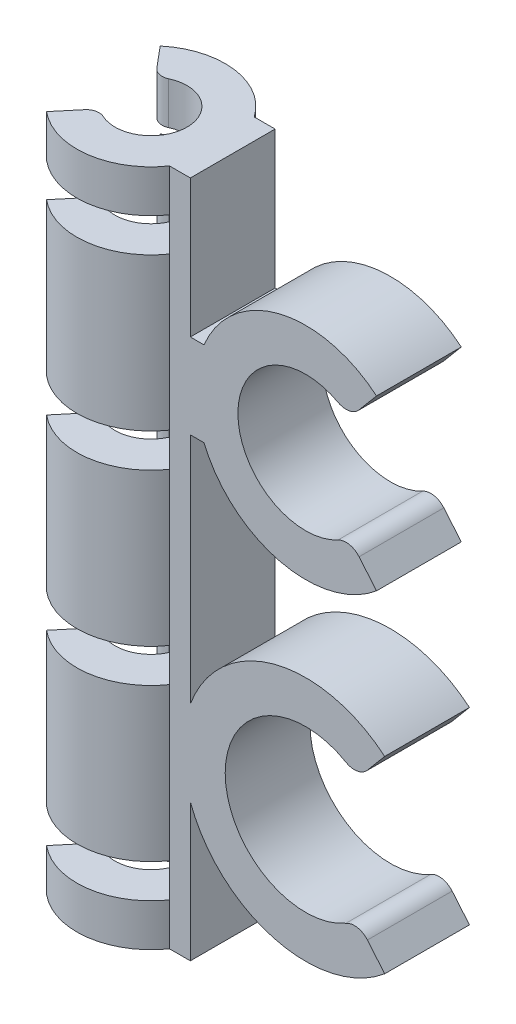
ISO-10303-21;
HEADER;
FILE_DESCRIPTION(('STEP AP214'),'2;1');
FILE_NAME('part.step','',(''),(''),'','','');
FILE_SCHEMA(('AUTOMOTIVE_DESIGN { 1 0 10303 214 1 1 1 1 }'));
ENDSEC;
DATA;
#1=APPLICATION_CONTEXT('core data for automotive mechanical design processes');
#2=APPLICATION_PROTOCOL_DEFINITION('international standard','automotive_design',2000,#1);
#3=PRODUCT_CONTEXT('',#1,'mechanical');
#4=PRODUCT('Part','Part','',(#3));
#5=PRODUCT_RELATED_PRODUCT_CATEGORY('part','',(#4));
#6=PRODUCT_DEFINITION_FORMATION('','',#4);
#7=PRODUCT_DEFINITION_CONTEXT('part definition',#1,'design');
#8=PRODUCT_DEFINITION('design','',#6,#7);
#9=PRODUCT_DEFINITION_SHAPE('','',#8);
#10=(LENGTH_UNIT() NAMED_UNIT(*) SI_UNIT(.MILLI.,.METRE.));
#11=(NAMED_UNIT(*) PLANE_ANGLE_UNIT() SI_UNIT($,.RADIAN.));
#12=(NAMED_UNIT(*) SI_UNIT($,.STERADIAN.) SOLID_ANGLE_UNIT());
#13=UNCERTAINTY_MEASURE_WITH_UNIT(LENGTH_MEASURE(1.E-05),#10,'distance_accuracy_value','');
#14=(GEOMETRIC_REPRESENTATION_CONTEXT(3) GLOBAL_UNCERTAINTY_ASSIGNED_CONTEXT((#13)) GLOBAL_UNIT_ASSIGNED_CONTEXT((#10,
#11,#12)) REPRESENTATION_CONTEXT('',''));
#15=CARTESIAN_POINT('',(0.,0.,0.));
#16=DIRECTION('',(0.,0.,1.));
#17=DIRECTION('',(1.,0.,0.));
#18=AXIS2_PLACEMENT_3D('',#15,#16,#17);
#19=CARTESIAN_POINT('',(0.,40.,0.));
#20=DIRECTION('',(0.,-1.,0.));
#21=DIRECTION('',(0.,0.,-1.));
#22=AXIS2_PLACEMENT_3D('',#19,#20,#21);
#23=CYLINDRICAL_SURFACE('',#22,8.75);
#24=CARTESIAN_POINT('',(0.,40.,0.));
#25=DIRECTION('',(0.,1.,0.));
#26=DIRECTION('',(0.,0.,1.));
#27=AXIS2_PLACEMENT_3D('',#24,#25,#26);
#28=CIRCLE('',#27,8.75);
#29=CARTESIAN_POINT('',(7.18070330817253,40.,-5.));
#30=VERTEX_POINT('',#29);
#31=CARTESIAN_POINT('',(-5.62439158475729,40.,-6.702888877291));
#32=VERTEX_POINT('',#31);
#33=EDGE_CURVE('E863',#30,#32,#28,.T.);
#34=ORIENTED_EDGE('',*,*,#33,.F.);
#35=DIRECTION('',(0.,-1.,0.));
#36=VECTOR('',#35,1.);
#37=CARTESIAN_POINT('',(7.18070330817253,40.,-5.));
#38=LINE('',#37,#36);
#39=CARTESIAN_POINT('',(7.18070330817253,35.,-5.));
#40=VERTEX_POINT('',#39);
#41=EDGE_CURVE('E569',#30,#40,#38,.T.);
#42=ORIENTED_EDGE('',*,*,#41,.T.);
#43=CARTESIAN_POINT('',(0.,35.,0.));
#44=DIRECTION('',(0.,-1.,0.));
#45=DIRECTION('',(0.,0.,-1.));
#46=AXIS2_PLACEMENT_3D('',#43,#44,#45);
#47=CIRCLE('',#46,8.75);
#48=CARTESIAN_POINT('',(-5.62439158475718,35.,-6.70288887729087));
#49=VERTEX_POINT('',#48);
#50=EDGE_CURVE('E730',#49,#40,#47,.T.);
#51=ORIENTED_EDGE('',*,*,#50,.F.);
#52=DIRECTION('',(0.,-1.,0.));
#53=VECTOR('',#52,1.);
#54=CARTESIAN_POINT('',(-5.62439158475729,40.,-6.702888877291));
#55=LINE('',#54,#53);
#56=EDGE_CURVE('E884',#32,#49,#55,.T.);
#57=ORIENTED_EDGE('',*,*,#56,.F.);
#58=EDGE_LOOP('',(#34,#42,#51,#57));
#59=FACE_BOUND('',#58,.T.);
#60=ADVANCED_FACE('F89',(#59),#23,.T.);
#61=CARTESIAN_POINT('',(0.,31.,0.));
#62=DIRECTION('',(0.,1.,0.));
#63=DIRECTION('',(-1.,0.,0.));
#64=AXIS2_PLACEMENT_3D('',#61,#62,#63);
#65=CIRCLE('',#64,8.75);
#66=CARTESIAN_POINT('',(7.18070330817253,31.,-5.));
#67=VERTEX_POINT('',#66);
#68=CARTESIAN_POINT('',(-5.62439158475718,31.,-6.70288887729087));
#69=VERTEX_POINT('',#68);
#70=EDGE_CURVE('E728',#67,#69,#65,.T.);
#71=ORIENTED_EDGE('',*,*,#70,.F.);
#72=DIRECTION('',(0.,-1.,0.));
#73=VECTOR('',#72,1.);
#74=CARTESIAN_POINT('',(7.18070330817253,40.,-5.));
#75=LINE('',#74,#73);
#76=CARTESIAN_POINT('',(7.18070330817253,13.,-5.));
#77=VERTEX_POINT('',#76);
#78=EDGE_CURVE('E894',#77,#67,#75,.F.);
#79=ORIENTED_EDGE('',*,*,#78,.F.);
#80=CARTESIAN_POINT('',(0.,13.,0.));
#81=DIRECTION('',(0.,-1.,0.));
#82=DIRECTION('',(1.,0.,0.));
#83=AXIS2_PLACEMENT_3D('',#80,#81,#82);
#84=CIRCLE('',#83,8.75);
#85=CARTESIAN_POINT('',(-5.62439158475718,13.,-6.70288887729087));
#86=VERTEX_POINT('',#85);
#87=EDGE_CURVE('E716',#86,#77,#84,.T.);
#88=ORIENTED_EDGE('',*,*,#87,.F.);
#89=EDGE_CURVE('E889',#69,#86,#55,.T.);
#90=ORIENTED_EDGE('',*,*,#89,.F.);
#91=EDGE_LOOP('',(#71,#79,#88,#90));
#92=FACE_BOUND('',#91,.T.);
#93=ADVANCED_FACE('F1406',(#92),#23,.T.);
#94=CARTESIAN_POINT('',(0.,9.,0.));
#95=DIRECTION('',(0.,1.,0.));
#96=DIRECTION('',(-1.,0.,0.));
#97=AXIS2_PLACEMENT_3D('',#94,#95,#96);
#98=CIRCLE('',#97,8.75);
#99=CARTESIAN_POINT('',(7.18070330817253,9.,-5.));
#100=VERTEX_POINT('',#99);
#101=CARTESIAN_POINT('',(-5.62439158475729,9.,-6.702888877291));
#102=VERTEX_POINT('',#101);
#103=EDGE_CURVE('E687',#100,#102,#98,.T.);
#104=ORIENTED_EDGE('',*,*,#103,.F.);
#105=CARTESIAN_POINT('',(7.18070330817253,-9.,-5.));
#106=VERTEX_POINT('',#105);
#107=EDGE_CURVE('E1378',#100,#106,#38,.T.);
#108=ORIENTED_EDGE('',*,*,#107,.T.);
#109=CARTESIAN_POINT('',(0.,-9.,0.));
#110=DIRECTION('',(0.,-1.,0.));
#111=DIRECTION('',(1.,0.,0.));
#112=AXIS2_PLACEMENT_3D('',#109,#110,#111);
#113=CIRCLE('',#112,8.75);
#114=CARTESIAN_POINT('',(-5.62439158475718,-9.,-6.70288887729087));
#115=VERTEX_POINT('',#114);
#116=EDGE_CURVE('E689',#115,#106,#113,.T.);
#117=ORIENTED_EDGE('',*,*,#116,.F.);
#118=EDGE_CURVE('E1271',#102,#115,#55,.T.);
#119=ORIENTED_EDGE('',*,*,#118,.F.);
#120=EDGE_LOOP('',(#104,#108,#117,#119));
#121=FACE_BOUND('',#120,.T.);
#122=ADVANCED_FACE('F1380',(#121),#23,.T.);
#123=CARTESIAN_POINT('',(0.,-13.,0.));
#124=DIRECTION('',(0.,1.,0.));
#125=DIRECTION('',(0.,0.,1.));
#126=AXIS2_PLACEMENT_3D('',#123,#124,#125);
#127=CIRCLE('',#126,8.75);
#128=CARTESIAN_POINT('',(7.18070330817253,-13.,-5.));
#129=VERTEX_POINT('',#128);
#130=CARTESIAN_POINT('',(-5.62439158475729,-13.,-6.702888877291));
#131=VERTEX_POINT('',#130);
#132=EDGE_CURVE('E660',#129,#131,#127,.T.);
#133=ORIENTED_EDGE('',*,*,#132,.F.);
#134=DIRECTION('',(0.,-1.,0.));
#135=VECTOR('',#134,1.);
#136=CARTESIAN_POINT('',(7.18070330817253,40.,-5.));
#137=LINE('',#136,#135);
#138=CARTESIAN_POINT('',(7.18070330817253,-31.,-5.));
#139=VERTEX_POINT('',#138);
#140=EDGE_CURVE('E901',#139,#129,#137,.F.);
#141=ORIENTED_EDGE('',*,*,#140,.F.);
#142=CARTESIAN_POINT('',(0.,-31.,0.));
#143=DIRECTION('',(0.,-1.,0.));
#144=DIRECTION('',(1.,0.,0.));
#145=AXIS2_PLACEMENT_3D('',#142,#143,#144);
#146=CIRCLE('',#145,8.75);
#147=CARTESIAN_POINT('',(-5.62439158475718,-31.,-6.70288887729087));
#148=VERTEX_POINT('',#147);
#149=EDGE_CURVE('E662',#148,#139,#146,.T.);
#150=ORIENTED_EDGE('',*,*,#149,.F.);
#151=EDGE_CURVE('E1275',#131,#148,#55,.T.);
#152=ORIENTED_EDGE('',*,*,#151,.F.);
#153=EDGE_LOOP('',(#133,#141,#150,#152));
#154=FACE_BOUND('',#153,.T.);
#155=ADVANCED_FACE('F1439',(#154),#23,.T.);
#156=CARTESIAN_POINT('',(0.,-35.,0.));
#157=DIRECTION('',(0.,1.,0.));
#158=DIRECTION('',(-1.,0.,0.));
#159=AXIS2_PLACEMENT_3D('',#156,#157,#158);
#160=CIRCLE('',#159,8.75);
#161=CARTESIAN_POINT('',(7.18070330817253,-35.,-5.));
#162=VERTEX_POINT('',#161);
#163=CARTESIAN_POINT('',(-5.62439158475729,-35.,-6.702888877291));
#164=VERTEX_POINT('',#163);
#165=EDGE_CURVE('E615',#162,#164,#160,.T.);
#166=ORIENTED_EDGE('',*,*,#165,.F.);
#167=CARTESIAN_POINT('',(7.18070330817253,-40.,-5.));
#168=VERTEX_POINT('',#167);
#169=EDGE_CURVE('E574',#162,#168,#38,.T.);
#170=ORIENTED_EDGE('',*,*,#169,.T.);
#171=CARTESIAN_POINT('',(0.,-40.,0.));
#172=DIRECTION('',(0.,1.,0.));
#173=DIRECTION('',(0.,0.,1.));
#174=AXIS2_PLACEMENT_3D('',#171,#172,#173);
#175=CIRCLE('',#174,8.75);
#176=CARTESIAN_POINT('',(-5.62439158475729,-40.,-6.702888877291));
#177=VERTEX_POINT('',#176);
#178=EDGE_CURVE('E876',#168,#177,#175,.T.);
#179=ORIENTED_EDGE('',*,*,#178,.T.);
#180=EDGE_CURVE('E869',#164,#177,#55,.T.);
#181=ORIENTED_EDGE('',*,*,#180,.F.);
#182=EDGE_LOOP('',(#166,#170,#179,#181));
#183=FACE_BOUND('',#182,.T.);
#184=ADVANCED_FACE('F1435',(#183),#23,.T.);
#185=CARTESIAN_POINT('',(-5.62439158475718,-40.,6.70288887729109));
#186=VERTEX_POINT('',#185);
#187=CARTESIAN_POINT('',(7.18070330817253,-40.,5.));
#188=VERTEX_POINT('',#187);
#189=EDGE_CURVE('E877',#186,#188,#175,.T.);
#190=ORIENTED_EDGE('',*,*,#189,.T.);
#191=DIRECTION('',(0.,-1.,0.));
#192=VECTOR('',#191,1.);
#193=CARTESIAN_POINT('',(7.18070330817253,40.,5.));
#194=LINE('',#193,#192);
#195=CARTESIAN_POINT('',(7.18070330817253,-35.,5.));
#196=VERTEX_POINT('',#195);
#197=EDGE_CURVE('E528',#196,#188,#194,.T.);
#198=ORIENTED_EDGE('',*,*,#197,.F.);
#199=CARTESIAN_POINT('',(-5.62439158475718,-35.,6.70288887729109));
#200=VERTEX_POINT('',#199);
#201=EDGE_CURVE('E643',#200,#196,#160,.T.);
#202=ORIENTED_EDGE('',*,*,#201,.F.);
#203=DIRECTION('',(0.,-1.,0.));
#204=VECTOR('',#203,1.);
#205=CARTESIAN_POINT('',(-5.62439158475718,40.,6.70288887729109));
#206=LINE('',#205,#204);
#207=EDGE_CURVE('E888',#200,#186,#206,.T.);
#208=ORIENTED_EDGE('',*,*,#207,.T.);
#209=EDGE_LOOP('',(#190,#198,#202,#208));
#210=FACE_BOUND('',#209,.T.);
#211=ADVANCED_FACE('F1213',(#210),#23,.T.);
#212=CARTESIAN_POINT('',(7.18070330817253,-31.,5.));
#213=VERTEX_POINT('',#212);
#214=CARTESIAN_POINT('',(-5.62439158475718,-31.,6.70288887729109));
#215=VERTEX_POINT('',#214);
#216=EDGE_CURVE('E661',#213,#215,#146,.T.);
#217=ORIENTED_EDGE('',*,*,#216,.F.);
#218=DIRECTION('',(0.,-1.,0.));
#219=VECTOR('',#218,1.);
#220=CARTESIAN_POINT('',(7.18070330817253,40.,5.));
#221=LINE('',#220,#219);
#222=CARTESIAN_POINT('',(7.18070330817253,-13.,5.));
#223=VERTEX_POINT('',#222);
#224=EDGE_CURVE('E904',#213,#223,#221,.F.);
#225=ORIENTED_EDGE('',*,*,#224,.T.);
#226=CARTESIAN_POINT('',(-5.62439158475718,-13.,6.70288887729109));
#227=VERTEX_POINT('',#226);
#228=EDGE_CURVE('E670',#227,#223,#127,.T.);
#229=ORIENTED_EDGE('',*,*,#228,.F.);
#230=EDGE_CURVE('E1196',#227,#215,#206,.T.);
#231=ORIENTED_EDGE('',*,*,#230,.T.);
#232=EDGE_LOOP('',(#217,#225,#229,#231));
#233=FACE_BOUND('',#232,.T.);
#234=ADVANCED_FACE('F1393',(#233),#23,.T.);
#235=CARTESIAN_POINT('',(7.18070330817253,-9.,5.));
#236=VERTEX_POINT('',#235);
#237=CARTESIAN_POINT('',(-5.62439158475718,-9.,6.70288887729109));
#238=VERTEX_POINT('',#237);
#239=EDGE_CURVE('E688',#236,#238,#113,.T.);
#240=ORIENTED_EDGE('',*,*,#239,.F.);
#241=CARTESIAN_POINT('',(7.18070330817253,9.,5.));
#242=VERTEX_POINT('',#241);
#243=EDGE_CURVE('E1232',#242,#236,#194,.T.);
#244=ORIENTED_EDGE('',*,*,#243,.F.);
#245=CARTESIAN_POINT('',(-5.62439158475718,9.,6.70288887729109));
#246=VERTEX_POINT('',#245);
#247=EDGE_CURVE('E697',#246,#242,#98,.T.);
#248=ORIENTED_EDGE('',*,*,#247,.F.);
#249=EDGE_CURVE('E1193',#246,#238,#206,.T.);
#250=ORIENTED_EDGE('',*,*,#249,.T.);
#251=EDGE_LOOP('',(#240,#244,#248,#250));
#252=FACE_BOUND('',#251,.T.);
#253=ADVANCED_FACE('F1238',(#252),#23,.T.);
#254=CARTESIAN_POINT('',(7.18070330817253,13.,5.));
#255=VERTEX_POINT('',#254);
#256=CARTESIAN_POINT('',(-5.62439158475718,13.,6.70288887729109));
#257=VERTEX_POINT('',#256);
#258=EDGE_CURVE('E715',#255,#257,#84,.T.);
#259=ORIENTED_EDGE('',*,*,#258,.F.);
#260=DIRECTION('',(0.,-1.,0.));
#261=VECTOR('',#260,1.);
#262=CARTESIAN_POINT('',(7.18070330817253,40.,5.));
#263=LINE('',#262,#261);
#264=CARTESIAN_POINT('',(7.18070330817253,31.,5.));
#265=VERTEX_POINT('',#264);
#266=EDGE_CURVE('E898',#255,#265,#263,.F.);
#267=ORIENTED_EDGE('',*,*,#266,.T.);
#268=CARTESIAN_POINT('',(-5.62439158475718,31.,6.70288887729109));
#269=VERTEX_POINT('',#268);
#270=EDGE_CURVE('E739',#269,#265,#65,.T.);
#271=ORIENTED_EDGE('',*,*,#270,.F.);
#272=EDGE_CURVE('E895',#269,#257,#206,.T.);
#273=ORIENTED_EDGE('',*,*,#272,.T.);
#274=EDGE_LOOP('',(#259,#267,#271,#273));
#275=FACE_BOUND('',#274,.T.);
#276=ADVANCED_FACE('F1187',(#275),#23,.T.);
#277=CARTESIAN_POINT('',(0.,40.,0.));
#278=DIRECTION('',(0.,-1.,0.));
#279=DIRECTION('',(0.,0.,-1.));
#280=AXIS2_PLACEMENT_3D('',#277,#278,#279);
#281=CYLINDRICAL_SURFACE('',#280,4.25);
#282=CARTESIAN_POINT('',(0.,31.,0.));
#283=DIRECTION('',(0.,1.,0.));
#284=DIRECTION('',(-1.,0.,0.));
#285=AXIS2_PLACEMENT_3D('',#282,#283,#284);
#286=CIRCLE('',#285,4.25);
#287=CARTESIAN_POINT('',(-1.78794440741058,31.,-3.85561341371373));
#288=VERTEX_POINT('',#287);
#289=CARTESIAN_POINT('',(-1.78794440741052,31.,3.85561341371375));
#290=VERTEX_POINT('',#289);
#291=EDGE_CURVE('E746',#288,#290,#286,.F.);
#292=ORIENTED_EDGE('',*,*,#291,.F.);
#293=DIRECTION('',(0.,-1.,0.));
#294=VECTOR('',#293,1.);
#295=CARTESIAN_POINT('',(-1.78794440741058,40.,-3.85561341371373));
#296=LINE('',#295,#294);
#297=CARTESIAN_POINT('',(-1.78794440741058,13.,-3.85561341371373));
#298=VERTEX_POINT('',#297);
#299=EDGE_CURVE('E1100',#288,#298,#296,.T.);
#300=ORIENTED_EDGE('',*,*,#299,.T.);
#301=CARTESIAN_POINT('',(0.,13.,0.));
#302=DIRECTION('',(0.,-1.,0.));
#303=DIRECTION('',(1.,0.,0.));
#304=AXIS2_PLACEMENT_3D('',#301,#302,#303);
#305=CIRCLE('',#304,4.25);
#306=CARTESIAN_POINT('',(-1.78794440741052,13.,3.85561341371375));
#307=VERTEX_POINT('',#306);
#308=EDGE_CURVE('E701',#307,#298,#305,.F.);
#309=ORIENTED_EDGE('',*,*,#308,.F.);
#310=DIRECTION('',(0.,-1.,0.));
#311=VECTOR('',#310,1.);
#312=CARTESIAN_POINT('',(-1.78794440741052,40.,3.85561341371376));
#313=LINE('',#312,#311);
#314=EDGE_CURVE('E1097',#307,#290,#313,.F.);
#315=ORIENTED_EDGE('',*,*,#314,.T.);
#316=EDGE_LOOP('',(#292,#300,#309,#315));
#317=FACE_BOUND('',#316,.T.);
#318=ADVANCED_FACE('F1422',(#317),#281,.F.);
#319=CARTESIAN_POINT('',(0.,35.,0.));
#320=DIRECTION('',(0.,-1.,0.));
#321=DIRECTION('',(0.,0.,-1.));
#322=AXIS2_PLACEMENT_3D('',#319,#320,#321);
#323=CIRCLE('',#322,4.25);
#324=CARTESIAN_POINT('',(-1.78794440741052,35.,3.85561341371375));
#325=VERTEX_POINT('',#324);
#326=CARTESIAN_POINT('',(-1.78794440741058,35.,-3.85561341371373));
#327=VERTEX_POINT('',#326);
#328=EDGE_CURVE('E731',#325,#327,#323,.F.);
#329=ORIENTED_EDGE('',*,*,#328,.F.);
#330=DIRECTION('',(0.,-1.,0.));
#331=VECTOR('',#330,1.);
#332=CARTESIAN_POINT('',(-1.78794440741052,40.,3.85561341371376));
#333=LINE('',#332,#331);
#334=CARTESIAN_POINT('',(-1.78794440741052,40.,3.85561341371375));
#335=VERTEX_POINT('',#334);
#336=EDGE_CURVE('E111',#325,#335,#333,.F.);
#337=ORIENTED_EDGE('',*,*,#336,.T.);
#338=CARTESIAN_POINT('',(0.,40.,0.));
#339=DIRECTION('',(0.,-1.,0.));
#340=DIRECTION('',(0.,0.,1.));
#341=AXIS2_PLACEMENT_3D('',#338,#339,#340);
#342=CIRCLE('',#341,4.25);
#343=CARTESIAN_POINT('',(-1.78794440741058,40.,-3.85561341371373));
#344=VERTEX_POINT('',#343);
#345=EDGE_CURVE('E856',#344,#335,#342,.T.);
#346=ORIENTED_EDGE('',*,*,#345,.F.);
#347=DIRECTION('',(0.,-1.,0.));
#348=VECTOR('',#347,1.);
#349=CARTESIAN_POINT('',(-1.78794440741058,40.,-3.85561341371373));
#350=LINE('',#349,#348);
#351=EDGE_CURVE('E1133',#344,#327,#350,.T.);
#352=ORIENTED_EDGE('',*,*,#351,.T.);
#353=EDGE_LOOP('',(#329,#337,#346,#352));
#354=FACE_BOUND('',#353,.T.);
#355=ADVANCED_FACE('F1153',(#354),#281,.F.);
#356=CARTESIAN_POINT('',(0.,9.,0.));
#357=DIRECTION('',(0.,1.,0.));
#358=DIRECTION('',(-1.,0.,0.));
#359=AXIS2_PLACEMENT_3D('',#356,#357,#358);
#360=CIRCLE('',#359,4.25);
#361=CARTESIAN_POINT('',(-1.78794440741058,9.,-3.85561341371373));
#362=VERTEX_POINT('',#361);
#363=CARTESIAN_POINT('',(-1.78794440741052,9.,3.85561341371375));
#364=VERTEX_POINT('',#363);
#365=EDGE_CURVE('E704',#362,#364,#360,.F.);
#366=ORIENTED_EDGE('',*,*,#365,.F.);
#367=DIRECTION('',(0.,-1.,0.));
#368=VECTOR('',#367,1.);
#369=CARTESIAN_POINT('',(-1.78794440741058,40.,-3.85561341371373));
#370=LINE('',#369,#368);
#371=CARTESIAN_POINT('',(-1.78794440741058,-9.,-3.85561341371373));
#372=VERTEX_POINT('',#371);
#373=EDGE_CURVE('E1074',#362,#372,#370,.T.);
#374=ORIENTED_EDGE('',*,*,#373,.T.);
#375=CARTESIAN_POINT('',(0.,-9.,0.));
#376=DIRECTION('',(0.,-1.,0.));
#377=DIRECTION('',(1.,0.,0.));
#378=AXIS2_PLACEMENT_3D('',#375,#376,#377);
#379=CIRCLE('',#378,4.25);
#380=CARTESIAN_POINT('',(-1.78794440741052,-9.,3.85561341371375));
#381=VERTEX_POINT('',#380);
#382=EDGE_CURVE('E674',#381,#372,#379,.F.);
#383=ORIENTED_EDGE('',*,*,#382,.F.);
#384=DIRECTION('',(0.,-1.,0.));
#385=VECTOR('',#384,1.);
#386=CARTESIAN_POINT('',(-1.78794440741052,40.,3.85561341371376));
#387=LINE('',#386,#385);
#388=EDGE_CURVE('E1071',#381,#364,#387,.F.);
#389=ORIENTED_EDGE('',*,*,#388,.T.);
#390=EDGE_LOOP('',(#366,#374,#383,#389));
#391=FACE_BOUND('',#390,.T.);
#392=ADVANCED_FACE('F1257',(#391),#281,.F.);
#393=CARTESIAN_POINT('',(0.,-13.,0.));
#394=DIRECTION('',(0.,1.,0.));
#395=DIRECTION('',(0.,0.,1.));
#396=AXIS2_PLACEMENT_3D('',#393,#394,#395);
#397=CIRCLE('',#396,4.25);
#398=CARTESIAN_POINT('',(-1.78794440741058,-13.,-3.85561341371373));
#399=VERTEX_POINT('',#398);
#400=CARTESIAN_POINT('',(-1.78794440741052,-13.,3.85561341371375));
#401=VERTEX_POINT('',#400);
#402=EDGE_CURVE('E677',#399,#401,#397,.F.);
#403=ORIENTED_EDGE('',*,*,#402,.F.);
#404=DIRECTION('',(0.,-1.,0.));
#405=VECTOR('',#404,1.);
#406=CARTESIAN_POINT('',(-1.78794440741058,40.,-3.85561341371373));
#407=LINE('',#406,#405);
#408=CARTESIAN_POINT('',(-1.78794440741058,-31.,-3.85561341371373));
#409=VERTEX_POINT('',#408);
#410=EDGE_CURVE('E1048',#399,#409,#407,.T.);
#411=ORIENTED_EDGE('',*,*,#410,.T.);
#412=CARTESIAN_POINT('',(0.,-31.,0.));
#413=DIRECTION('',(0.,-1.,0.));
#414=DIRECTION('',(1.,0.,0.));
#415=AXIS2_PLACEMENT_3D('',#412,#413,#414);
#416=CIRCLE('',#415,4.25);
#417=CARTESIAN_POINT('',(-1.78794440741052,-31.,3.85561341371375));
#418=VERTEX_POINT('',#417);
#419=EDGE_CURVE('E647',#418,#409,#416,.F.);
#420=ORIENTED_EDGE('',*,*,#419,.F.);
#421=DIRECTION('',(0.,-1.,0.));
#422=VECTOR('',#421,1.);
#423=CARTESIAN_POINT('',(-1.78794440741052,40.,3.85561341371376));
#424=LINE('',#423,#422);
#425=EDGE_CURVE('E1045',#418,#401,#424,.F.);
#426=ORIENTED_EDGE('',*,*,#425,.T.);
#427=EDGE_LOOP('',(#403,#411,#420,#426));
#428=FACE_BOUND('',#427,.T.);
#429=ADVANCED_FACE('F1342',(#428),#281,.F.);
#430=CARTESIAN_POINT('',(0.,-40.,0.));
#431=DIRECTION('',(0.,-1.,0.));
#432=DIRECTION('',(0.,0.,1.));
#433=AXIS2_PLACEMENT_3D('',#430,#431,#432);
#434=CIRCLE('',#433,4.25);
#435=CARTESIAN_POINT('',(-1.78794440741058,-40.,-3.85561341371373));
#436=VERTEX_POINT('',#435);
#437=CARTESIAN_POINT('',(-1.78794440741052,-40.,3.85561341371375));
#438=VERTEX_POINT('',#437);
#439=EDGE_CURVE('E855',#436,#438,#434,.T.);
#440=ORIENTED_EDGE('',*,*,#439,.T.);
#441=DIRECTION('',(0.,-1.,0.));
#442=VECTOR('',#441,1.);
#443=CARTESIAN_POINT('',(-1.78794440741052,40.,3.85561341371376));
#444=LINE('',#443,#442);
#445=CARTESIAN_POINT('',(-1.78794440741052,-35.,3.85561341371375));
#446=VERTEX_POINT('',#445);
#447=EDGE_CURVE('E1033',#438,#446,#444,.F.);
#448=ORIENTED_EDGE('',*,*,#447,.T.);
#449=CARTESIAN_POINT('',(0.,-35.,0.));
#450=DIRECTION('',(0.,1.,0.));
#451=DIRECTION('',(-1.,0.,0.));
#452=AXIS2_PLACEMENT_3D('',#449,#450,#451);
#453=CIRCLE('',#452,4.25);
#454=CARTESIAN_POINT('',(-1.78794440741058,-35.,-3.85561341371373));
#455=VERTEX_POINT('',#454);
#456=EDGE_CURVE('E650',#455,#446,#453,.F.);
#457=ORIENTED_EDGE('',*,*,#456,.F.);
#458=DIRECTION('',(0.,-1.,0.));
#459=VECTOR('',#458,1.);
#460=CARTESIAN_POINT('',(-1.78794440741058,40.,-3.85561341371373));
#461=LINE('',#460,#459);
#462=EDGE_CURVE('E1029',#455,#436,#461,.T.);
#463=ORIENTED_EDGE('',*,*,#462,.T.);
#464=EDGE_LOOP('',(#440,#448,#457,#463));
#465=FACE_BOUND('',#464,.T.);
#466=ADVANCED_FACE('F1302',(#465),#281,.F.);
#467=CARTESIAN_POINT('',(-5.62439158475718,40.,6.70288887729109));
#468=DIRECTION('',(0.766044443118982,0.,0.642787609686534));
#469=DIRECTION('',(0.642787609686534,0.,-0.766044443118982));
#470=AXIS2_PLACEMENT_3D('',#467,#468,#469);
#471=PLANE('',#470);
#472=DIRECTION('',(-0.642787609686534,0.,0.766044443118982));
#473=VECTOR('',#472,1.);
#474=CARTESIAN_POINT('',(-5.62439158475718,31.,6.70288887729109));
#475=LINE('',#474,#473);
#476=CARTESIAN_POINT('',(-3.56805027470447,31.,4.25223673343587));
#477=VERTEX_POINT('',#476);
#478=EDGE_CURVE('E744',#477,#269,#475,.T.);
#479=ORIENTED_EDGE('',*,*,#478,.F.);
#480=DIRECTION('',(0.,-1.,0.));
#481=VECTOR('',#480,1.);
#482=CARTESIAN_POINT('',(-3.56805027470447,40.,4.25223673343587));
#483=LINE('',#482,#481);
#484=CARTESIAN_POINT('',(-3.56805027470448,13.,4.25223673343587));
#485=VERTEX_POINT('',#484);
#486=EDGE_CURVE('E1119',#477,#485,#483,.T.);
#487=ORIENTED_EDGE('',*,*,#486,.T.);
#488=DIRECTION('',(0.642787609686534,0.,-0.766044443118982));
#489=VECTOR('',#488,1.);
#490=CARTESIAN_POINT('',(-5.62439158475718,13.,6.70288887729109));
#491=LINE('',#490,#489);
#492=EDGE_CURVE('E720',#257,#485,#491,.T.);
#493=ORIENTED_EDGE('',*,*,#492,.F.);
#494=ORIENTED_EDGE('',*,*,#272,.F.);
#495=EDGE_LOOP('',(#479,#487,#493,#494));
#496=FACE_BOUND('',#495,.T.);
#497=ADVANCED_FACE('F1190',(#496),#471,.F.);
#498=DIRECTION('',(-0.642787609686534,0.,0.766044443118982));
#499=VECTOR('',#498,1.);
#500=CARTESIAN_POINT('',(-5.62439158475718,40.,6.70288887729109));
#501=LINE('',#500,#499);
#502=CARTESIAN_POINT('',(-3.56805027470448,40.,4.25223673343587));
#503=VERTEX_POINT('',#502);
#504=CARTESIAN_POINT('',(-5.62439158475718,40.,6.70288887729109));
#505=VERTEX_POINT('',#504);
#506=EDGE_CURVE('E859',#503,#505,#501,.T.);
#507=ORIENTED_EDGE('',*,*,#506,.F.);
#508=DIRECTION('',(0.,-1.,0.));
#509=VECTOR('',#508,1.);
#510=CARTESIAN_POINT('',(-3.56805027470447,40.,4.25223673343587));
#511=LINE('',#510,#509);
#512=CARTESIAN_POINT('',(-3.56805027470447,35.,4.25223673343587));
#513=VERTEX_POINT('',#512);
#514=EDGE_CURVE('E1123',#503,#513,#511,.T.);
#515=ORIENTED_EDGE('',*,*,#514,.T.);
#516=DIRECTION('',(0.642787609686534,0.,-0.766044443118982));
#517=VECTOR('',#516,1.);
#518=CARTESIAN_POINT('',(-5.62439158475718,35.,6.70288887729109));
#519=LINE('',#518,#517);
#520=CARTESIAN_POINT('',(-5.62439158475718,35.,6.70288887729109));
#521=VERTEX_POINT('',#520);
#522=EDGE_CURVE('E735',#521,#513,#519,.T.);
#523=ORIENTED_EDGE('',*,*,#522,.F.);
#524=EDGE_CURVE('E890',#505,#521,#206,.T.);
#525=ORIENTED_EDGE('',*,*,#524,.F.);
#526=EDGE_LOOP('',(#507,#515,#523,#525));
#527=FACE_BOUND('',#526,.T.);
#528=ADVANCED_FACE('F1148',(#527),#471,.F.);
#529=DIRECTION('',(-0.642787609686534,0.,0.766044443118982));
#530=VECTOR('',#529,1.);
#531=CARTESIAN_POINT('',(-5.62439158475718,9.,6.70288887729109));
#532=LINE('',#531,#530);
#533=CARTESIAN_POINT('',(-3.56805027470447,9.,4.25223673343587));
#534=VERTEX_POINT('',#533);
#535=EDGE_CURVE('E702',#534,#246,#532,.T.);
#536=ORIENTED_EDGE('',*,*,#535,.F.);
#537=DIRECTION('',(0.,-1.,0.));
#538=VECTOR('',#537,1.);
#539=CARTESIAN_POINT('',(-3.56805027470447,40.,4.25223673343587));
#540=LINE('',#539,#538);
#541=CARTESIAN_POINT('',(-3.56805027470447,-9.,4.25223673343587));
#542=VERTEX_POINT('',#541);
#543=EDGE_CURVE('E1093',#534,#542,#540,.T.);
#544=ORIENTED_EDGE('',*,*,#543,.T.);
#545=DIRECTION('',(0.642787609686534,0.,-0.766044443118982));
#546=VECTOR('',#545,1.);
#547=CARTESIAN_POINT('',(-5.62439158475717,-9.,6.70288887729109));
#548=LINE('',#547,#546);
#549=EDGE_CURVE('E693',#238,#542,#548,.T.);
#550=ORIENTED_EDGE('',*,*,#549,.F.);
#551=ORIENTED_EDGE('',*,*,#249,.F.);
#552=EDGE_LOOP('',(#536,#544,#550,#551));
#553=FACE_BOUND('',#552,.T.);
#554=ADVANCED_FACE('F1247',(#553),#471,.F.);
#555=DIRECTION('',(-0.642787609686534,0.,0.766044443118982));
#556=VECTOR('',#555,1.);
#557=CARTESIAN_POINT('',(-5.62439158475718,-13.,6.70288887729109));
#558=LINE('',#557,#556);
#559=CARTESIAN_POINT('',(-3.56805027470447,-13.,4.25223673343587));
#560=VERTEX_POINT('',#559);
#561=EDGE_CURVE('E675',#560,#227,#558,.T.);
#562=ORIENTED_EDGE('',*,*,#561,.F.);
#563=DIRECTION('',(0.,-1.,0.));
#564=VECTOR('',#563,1.);
#565=CARTESIAN_POINT('',(-3.56805027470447,40.,4.25223673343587));
#566=LINE('',#565,#564);
#567=CARTESIAN_POINT('',(-3.56805027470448,-31.,4.25223673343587));
#568=VERTEX_POINT('',#567);
#569=EDGE_CURVE('E1067',#560,#568,#566,.T.);
#570=ORIENTED_EDGE('',*,*,#569,.T.);
#571=DIRECTION('',(0.642787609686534,0.,-0.766044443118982));
#572=VECTOR('',#571,1.);
#573=CARTESIAN_POINT('',(-5.62439158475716,-31.,6.70288887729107));
#574=LINE('',#573,#572);
#575=EDGE_CURVE('E666',#215,#568,#574,.T.);
#576=ORIENTED_EDGE('',*,*,#575,.F.);
#577=ORIENTED_EDGE('',*,*,#230,.F.);
#578=EDGE_LOOP('',(#562,#570,#576,#577));
#579=FACE_BOUND('',#578,.T.);
#580=ADVANCED_FACE('F1333',(#579),#471,.F.);
#581=DIRECTION('',(-0.642787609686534,0.,0.766044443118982));
#582=VECTOR('',#581,1.);
#583=CARTESIAN_POINT('',(-5.62439158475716,-35.,6.70288887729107));
#584=LINE('',#583,#582);
#585=CARTESIAN_POINT('',(-3.56805027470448,-35.,4.25223673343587));
#586=VERTEX_POINT('',#585);
#587=EDGE_CURVE('E648',#586,#200,#584,.T.);
#588=ORIENTED_EDGE('',*,*,#587,.F.);
#589=DIRECTION('',(0.,-1.,0.));
#590=VECTOR('',#589,1.);
#591=CARTESIAN_POINT('',(-3.56805027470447,40.,4.25223673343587));
#592=LINE('',#591,#590);
#593=CARTESIAN_POINT('',(-3.56805027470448,-40.,4.25223673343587));
#594=VERTEX_POINT('',#593);
#595=EDGE_CURVE('E1019',#586,#594,#592,.T.);
#596=ORIENTED_EDGE('',*,*,#595,.T.);
#597=DIRECTION('',(-0.642787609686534,0.,0.766044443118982));
#598=VECTOR('',#597,1.);
#599=CARTESIAN_POINT('',(-5.62439158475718,-40.,6.70288887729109));
#600=LINE('',#599,#598);
#601=EDGE_CURVE('E873',#594,#186,#600,.T.);
#602=ORIENTED_EDGE('',*,*,#601,.T.);
#603=ORIENTED_EDGE('',*,*,#207,.F.);
#604=EDGE_LOOP('',(#588,#596,#602,#603));
#605=FACE_BOUND('',#604,.T.);
#606=ADVANCED_FACE('F1310',(#605),#471,.F.);
#607=CARTESIAN_POINT('',(7.18070330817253,35.,5.));
#608=VERTEX_POINT('',#607);
#609=EDGE_CURVE('E729',#608,#521,#47,.T.);
#610=ORIENTED_EDGE('',*,*,#609,.F.);
#611=CARTESIAN_POINT('',(7.18070330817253,40.,5.));
#612=VERTEX_POINT('',#611);
#613=EDGE_CURVE('E575',#612,#608,#194,.T.);
#614=ORIENTED_EDGE('',*,*,#613,.F.);
#615=EDGE_CURVE('E540',#505,#612,#28,.T.);
#616=ORIENTED_EDGE('',*,*,#615,.F.);
#617=ORIENTED_EDGE('',*,*,#524,.T.);
#618=EDGE_LOOP('',(#610,#614,#616,#617));
#619=FACE_BOUND('',#618,.T.);
#620=ADVANCED_FACE('F1170',(#619),#23,.T.);
#621=CARTESIAN_POINT('',(-2.73184734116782,40.,-3.25568888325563));
#622=DIRECTION('',(0.766044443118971,0.,-0.642787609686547));
#623=DIRECTION('',(-0.642787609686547,0.,-0.766044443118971));
#624=AXIS2_PLACEMENT_3D('',#621,#622,#623);
#625=PLANE('',#624);
#626=DIRECTION('',(-0.642787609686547,0.,-0.766044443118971));
#627=VECTOR('',#626,1.);
#628=CARTESIAN_POINT('',(-2.73184734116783,13.,-3.25568888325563));
#629=LINE('',#628,#627);
#630=CARTESIAN_POINT('',(-3.56805027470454,13.,-4.25223673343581));
#631=VERTEX_POINT('',#630);
#632=EDGE_CURVE('E925',#631,#86,#629,.T.);
#633=ORIENTED_EDGE('',*,*,#632,.F.);
#634=DIRECTION('',(0.,-1.,0.));
#635=VECTOR('',#634,1.);
#636=CARTESIAN_POINT('',(-3.56805027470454,40.,-4.25223673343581));
#637=LINE('',#636,#635);
#638=CARTESIAN_POINT('',(-3.56805027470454,31.,-4.25223673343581));
#639=VERTEX_POINT('',#638);
#640=EDGE_CURVE('E1110',#631,#639,#637,.F.);
#641=ORIENTED_EDGE('',*,*,#640,.T.);
#642=DIRECTION('',(0.642787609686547,0.,0.766044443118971));
#643=VECTOR('',#642,1.);
#644=CARTESIAN_POINT('',(-2.73184734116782,31.,-3.25568888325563));
#645=LINE('',#644,#643);
#646=EDGE_CURVE('E931',#69,#639,#645,.T.);
#647=ORIENTED_EDGE('',*,*,#646,.F.);
#648=ORIENTED_EDGE('',*,*,#89,.T.);
#649=EDGE_LOOP('',(#633,#641,#647,#648));
#650=FACE_BOUND('',#649,.T.);
#651=ADVANCED_FACE('F1415',(#650),#625,.F.);
#652=DIRECTION('',(-0.642787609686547,0.,-0.766044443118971));
#653=VECTOR('',#652,1.);
#654=CARTESIAN_POINT('',(-2.73184734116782,35.,-3.25568888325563));
#655=LINE('',#654,#653);
#656=CARTESIAN_POINT('',(-3.56805027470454,35.,-4.25223673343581));
#657=VERTEX_POINT('',#656);
#658=EDGE_CURVE('E928',#657,#49,#655,.T.);
#659=ORIENTED_EDGE('',*,*,#658,.F.);
#660=DIRECTION('',(0.,-1.,0.));
#661=VECTOR('',#660,1.);
#662=CARTESIAN_POINT('',(-3.56805027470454,40.,-4.25223673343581));
#663=LINE('',#662,#661);
#664=CARTESIAN_POINT('',(-3.56805027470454,40.,-4.25223673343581));
#665=VERTEX_POINT('',#664);
#666=EDGE_CURVE('E12',#657,#665,#663,.F.);
#667=ORIENTED_EDGE('',*,*,#666,.T.);
#668=DIRECTION('',(0.642787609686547,0.,0.766044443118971));
#669=VECTOR('',#668,1.);
#670=CARTESIAN_POINT('',(-2.73184734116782,40.,-3.25568888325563));
#671=LINE('',#670,#669);
#672=EDGE_CURVE('E866',#32,#665,#671,.T.);
#673=ORIENTED_EDGE('',*,*,#672,.F.);
#674=ORIENTED_EDGE('',*,*,#56,.T.);
#675=EDGE_LOOP('',(#659,#667,#673,#674));
#676=FACE_BOUND('',#675,.T.);
#677=ADVANCED_FACE('F1159',(#676),#625,.F.);
#678=DIRECTION('',(-0.642787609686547,0.,-0.766044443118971));
#679=VECTOR('',#678,1.);
#680=CARTESIAN_POINT('',(-2.73184734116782,-9.,-3.25568888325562));
#681=LINE('',#680,#679);
#682=CARTESIAN_POINT('',(-3.56805027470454,-9.,-4.25223673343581));
#683=VERTEX_POINT('',#682);
#684=EDGE_CURVE('E918',#683,#115,#681,.T.);
#685=ORIENTED_EDGE('',*,*,#684,.F.);
#686=DIRECTION('',(0.,-1.,0.));
#687=VECTOR('',#686,1.);
#688=CARTESIAN_POINT('',(-3.56805027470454,40.,-4.25223673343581));
#689=LINE('',#688,#687);
#690=CARTESIAN_POINT('',(-3.56805027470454,9.,-4.25223673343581));
#691=VERTEX_POINT('',#690);
#692=EDGE_CURVE('E1084',#683,#691,#689,.F.);
#693=ORIENTED_EDGE('',*,*,#692,.T.);
#694=DIRECTION('',(0.642787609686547,0.,0.766044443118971));
#695=VECTOR('',#694,1.);
#696=CARTESIAN_POINT('',(-2.73184734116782,9.,-3.25568888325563));
#697=LINE('',#696,#695);
#698=EDGE_CURVE('E921',#102,#691,#697,.T.);
#699=ORIENTED_EDGE('',*,*,#698,.F.);
#700=ORIENTED_EDGE('',*,*,#118,.T.);
#701=EDGE_LOOP('',(#685,#693,#699,#700));
#702=FACE_BOUND('',#701,.T.);
#703=ADVANCED_FACE('F1268',(#702),#625,.F.);
#704=DIRECTION('',(-0.642787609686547,0.,-0.766044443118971));
#705=VECTOR('',#704,1.);
#706=CARTESIAN_POINT('',(-2.73184734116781,-31.,-3.25568888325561));
#707=LINE('',#706,#705);
#708=CARTESIAN_POINT('',(-3.56805027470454,-31.,-4.25223673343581));
#709=VERTEX_POINT('',#708);
#710=EDGE_CURVE('E911',#709,#148,#707,.T.);
#711=ORIENTED_EDGE('',*,*,#710,.F.);
#712=DIRECTION('',(0.,-1.,0.));
#713=VECTOR('',#712,1.);
#714=CARTESIAN_POINT('',(-3.56805027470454,40.,-4.25223673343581));
#715=LINE('',#714,#713);
#716=CARTESIAN_POINT('',(-3.56805027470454,-13.,-4.25223673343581));
#717=VERTEX_POINT('',#716);
#718=EDGE_CURVE('E1058',#709,#717,#715,.F.);
#719=ORIENTED_EDGE('',*,*,#718,.T.);
#720=DIRECTION('',(0.642787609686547,0.,0.766044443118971));
#721=VECTOR('',#720,1.);
#722=CARTESIAN_POINT('',(-2.73184734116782,-13.,-3.25568888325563));
#723=LINE('',#722,#721);
#724=EDGE_CURVE('E914',#131,#717,#723,.T.);
#725=ORIENTED_EDGE('',*,*,#724,.F.);
#726=ORIENTED_EDGE('',*,*,#151,.T.);
#727=EDGE_LOOP('',(#711,#719,#725,#726));
#728=FACE_BOUND('',#727,.T.);
#729=ADVANCED_FACE('F1348',(#728),#625,.F.);
#730=DIRECTION('',(0.642787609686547,0.,0.766044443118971));
#731=VECTOR('',#730,1.);
#732=CARTESIAN_POINT('',(-2.73184734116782,-40.,-3.25568888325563));
#733=LINE('',#732,#731);
#734=CARTESIAN_POINT('',(-3.56805027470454,-40.,-4.25223673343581));
#735=VERTEX_POINT('',#734);
#736=EDGE_CURVE('E860',#177,#735,#733,.T.);
#737=ORIENTED_EDGE('',*,*,#736,.T.);
#738=DIRECTION('',(0.,-1.,0.));
#739=VECTOR('',#738,1.);
#740=CARTESIAN_POINT('',(-3.56805027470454,40.,-4.25223673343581));
#741=LINE('',#740,#739);
#742=CARTESIAN_POINT('',(-3.56805027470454,-35.,-4.25223673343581));
#743=VERTEX_POINT('',#742);
#744=EDGE_CURVE('E1042',#735,#743,#741,.F.);
#745=ORIENTED_EDGE('',*,*,#744,.T.);
#746=DIRECTION('',(0.642787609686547,0.,0.766044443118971));
#747=VECTOR('',#746,1.);
#748=CARTESIAN_POINT('',(-2.73184734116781,-35.,-3.25568888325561));
#749=LINE('',#748,#747);
#750=EDGE_CURVE('E907',#164,#743,#749,.T.);
#751=ORIENTED_EDGE('',*,*,#750,.F.);
#752=ORIENTED_EDGE('',*,*,#180,.T.);
#753=EDGE_LOOP('',(#737,#745,#751,#752));
#754=FACE_BOUND('',#753,.T.);
#755=ADVANCED_FACE('F1290',(#754),#625,.F.);
#756=CARTESIAN_POINT('',(0.,40.,0.));
#757=DIRECTION('',(0.,1.,0.));
#758=DIRECTION('',(0.,0.,1.));
#759=AXIS2_PLACEMENT_3D('',#756,#757,#758);
#760=PLANE('',#759);
#761=ORIENTED_EDGE('',*,*,#345,.T.);
#762=CARTESIAN_POINT('',(-2.418983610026,40.,5.21641814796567));
#763=DIRECTION('',(0.,1.,0.));
#764=DIRECTION('',(0.,0.,1.));
#765=AXIS2_PLACEMENT_3D('',#762,#763,#764);
#766=CIRCLE('',#765,1.5);
#767=EDGE_CURVE('E98',#335,#503,#766,.T.);
#768=ORIENTED_EDGE('',*,*,#767,.T.);
#769=ORIENTED_EDGE('',*,*,#506,.T.);
#770=ORIENTED_EDGE('',*,*,#615,.T.);
#771=DIRECTION('',(-1.,0.,0.));
#772=VECTOR('',#771,1.);
#773=CARTESIAN_POINT('',(9.6393424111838,40.,5.));
#774=LINE('',#773,#772);
#775=CARTESIAN_POINT('',(9.6393424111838,40.,5.));
#776=VERTEX_POINT('',#775);
#777=EDGE_CURVE('E520',#776,#612,#774,.T.);
#778=ORIENTED_EDGE('',*,*,#777,.F.);
#779=DIRECTION('',(0.,0.,1.));
#780=VECTOR('',#779,1.);
#781=CARTESIAN_POINT('',(9.6393424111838,40.,-5.));
#782=LINE('',#781,#780);
#783=CARTESIAN_POINT('',(9.6393424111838,40.,-5.));
#784=VERTEX_POINT('',#783);
#785=EDGE_CURVE('E537',#784,#776,#782,.T.);
#786=ORIENTED_EDGE('',*,*,#785,.F.);
#787=DIRECTION('',(1.,0.,0.));
#788=VECTOR('',#787,1.);
#789=CARTESIAN_POINT('',(7.18070330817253,40.,-5.));
#790=LINE('',#789,#788);
#791=EDGE_CURVE('E542',#30,#784,#790,.T.);
#792=ORIENTED_EDGE('',*,*,#791,.F.);
#793=ORIENTED_EDGE('',*,*,#33,.T.);
#794=ORIENTED_EDGE('',*,*,#672,.T.);
#795=CARTESIAN_POINT('',(-2.41898361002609,40.,-5.21641814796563));
#796=DIRECTION('',(0.,1.,0.));
#797=DIRECTION('',(0.,0.,1.));
#798=AXIS2_PLACEMENT_3D('',#795,#796,#797);
#799=CIRCLE('',#798,1.5);
#800=EDGE_CURVE('E1139',#665,#344,#799,.T.);
#801=ORIENTED_EDGE('',*,*,#800,.T.);
#802=EDGE_LOOP('',(#761,#768,#769,#770,#778,#786,#792,#793,#794,#801));
#803=FACE_BOUND('',#802,.T.);
#804=ADVANCED_FACE('F535',(#803),#760,.T.);
#805=CARTESIAN_POINT('',(0.,-40.,0.));
#806=DIRECTION('',(0.,1.,0.));
#807=DIRECTION('',(0.,0.,1.));
#808=AXIS2_PLACEMENT_3D('',#805,#806,#807);
#809=PLANE('',#808);
#810=ORIENTED_EDGE('',*,*,#601,.F.);
#811=CARTESIAN_POINT('',(-2.418983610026,-40.,5.21641814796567));
#812=DIRECTION('',(0.,1.,0.));
#813=DIRECTION('',(0.,0.,1.));
#814=AXIS2_PLACEMENT_3D('',#811,#812,#813);
#815=CIRCLE('',#814,1.5);
#816=EDGE_CURVE('E1026',#594,#438,#815,.F.);
#817=ORIENTED_EDGE('',*,*,#816,.T.);
#818=ORIENTED_EDGE('',*,*,#439,.F.);
#819=CARTESIAN_POINT('',(-2.41898361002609,-40.,-5.21641814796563));
#820=DIRECTION('',(0.,1.,0.));
#821=DIRECTION('',(0.,0.,1.));
#822=AXIS2_PLACEMENT_3D('',#819,#820,#821);
#823=CIRCLE('',#822,1.5);
#824=EDGE_CURVE('E1023',#436,#735,#823,.F.);
#825=ORIENTED_EDGE('',*,*,#824,.T.);
#826=ORIENTED_EDGE('',*,*,#736,.F.);
#827=ORIENTED_EDGE('',*,*,#178,.F.);
#828=DIRECTION('',(1.,0.,0.));
#829=VECTOR('',#828,1.);
#830=CARTESIAN_POINT('',(7.18070330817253,-40.,-5.));
#831=LINE('',#830,#829);
#832=CARTESIAN_POINT('',(9.6393424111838,-40.,-5.));
#833=VERTEX_POINT('',#832);
#834=EDGE_CURVE('E548',#168,#833,#831,.T.);
#835=ORIENTED_EDGE('',*,*,#834,.T.);
#836=DIRECTION('',(0.,0.,1.));
#837=VECTOR('',#836,1.);
#838=CARTESIAN_POINT('',(9.6393424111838,-40.,-5.));
#839=LINE('',#838,#837);
#840=CARTESIAN_POINT('',(9.6393424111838,-40.,5.));
#841=VERTEX_POINT('',#840);
#842=EDGE_CURVE('E557',#833,#841,#839,.T.);
#843=ORIENTED_EDGE('',*,*,#842,.T.);
#844=DIRECTION('',(-1.,0.,0.));
#845=VECTOR('',#844,1.);
#846=CARTESIAN_POINT('',(9.6393424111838,-40.,5.));
#847=LINE('',#846,#845);
#848=EDGE_CURVE('E552',#841,#188,#847,.T.);
#849=ORIENTED_EDGE('',*,*,#848,.T.);
#850=ORIENTED_EDGE('',*,*,#189,.F.);
#851=EDGE_LOOP('',(#810,#817,#818,#825,#826,#827,#835,#843,#849,#850));
#852=FACE_BOUND('',#851,.T.);
#853=ADVANCED_FACE('F1219',(#852),#809,.F.);
#854=CARTESIAN_POINT('',(0.,0.,5.));
#855=DIRECTION('',(0.,0.,1.));
#856=DIRECTION('',(1.,0.,0.));
#857=AXIS2_PLACEMENT_3D('',#854,#855,#856);
#858=PLANE('',#857);
#859=DIRECTION('',(1.,0.,0.));
#860=VECTOR('',#859,1.);
#861=CARTESIAN_POINT('',(0.,23.75,5.));
#862=LINE('',#861,#860);
#863=CARTESIAN_POINT('',(9.6393424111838,23.75,5.));
#864=VERTEX_POINT('',#863);
#865=CARTESIAN_POINT('',(11.25,23.75,5.));
#866=VERTEX_POINT('',#865);
#867=EDGE_CURVE('E523',#864,#866,#862,.T.);
#868=ORIENTED_EDGE('',*,*,#867,.F.);
#869=DIRECTION('',(0.,-1.,0.));
#870=VECTOR('',#869,1.);
#871=CARTESIAN_POINT('',(9.6393424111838,40.,5.));
#872=LINE('',#871,#870);
#873=EDGE_CURVE('E516',#776,#864,#872,.T.);
#874=ORIENTED_EDGE('',*,*,#873,.F.);
#875=ORIENTED_EDGE('',*,*,#777,.T.);
#876=ORIENTED_EDGE('',*,*,#613,.T.);
#877=EDGE_CURVE('E577',#608,#265,#194,.T.);
#878=ORIENTED_EDGE('',*,*,#877,.T.);
#879=ORIENTED_EDGE('',*,*,#266,.F.);
#880=EDGE_CURVE('E1176',#255,#242,#194,.T.);
#881=ORIENTED_EDGE('',*,*,#880,.T.);
#882=ORIENTED_EDGE('',*,*,#243,.T.);
#883=EDGE_CURVE('E1229',#236,#223,#194,.T.);
#884=ORIENTED_EDGE('',*,*,#883,.T.);
#885=ORIENTED_EDGE('',*,*,#224,.F.);
#886=EDGE_CURVE('E1226',#213,#196,#194,.T.);
#887=ORIENTED_EDGE('',*,*,#886,.T.);
#888=ORIENTED_EDGE('',*,*,#197,.T.);
#889=ORIENTED_EDGE('',*,*,#848,.F.);
#890=CARTESIAN_POINT('',(9.6393424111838,-23.75,5.));
#891=VERTEX_POINT('',#890);
#892=EDGE_CURVE('E531',#891,#841,#872,.T.);
#893=ORIENTED_EDGE('',*,*,#892,.F.);
#894=CARTESIAN_POINT('',(23.25,-18.75,5.));
#895=DIRECTION('',(0.,0.,1.));
#896=DIRECTION('',(1.,0.,0.));
#897=AXIS2_PLACEMENT_3D('',#894,#895,#896);
#898=CIRCLE('',#897,14.5);
#899=CARTESIAN_POINT('',(32.5704203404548,-29.8576444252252,5.));
#900=VERTEX_POINT('',#899);
#901=EDGE_CURVE('E752',#891,#900,#898,.T.);
#902=ORIENTED_EDGE('',*,*,#901,.T.);
#903=DIRECTION('',(-0.642787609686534,0.766044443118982,0.));
#904=VECTOR('',#903,1.);
#905=CARTESIAN_POINT('',(4.4110873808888,3.70134179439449,5.));
#906=LINE('',#905,#904);
#907=CARTESIAN_POINT('',(30.5294100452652,-27.4252630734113,5.));
#908=VERTEX_POINT('',#907);
#909=EDGE_CURVE('E755',#900,#908,#906,.T.);
#910=ORIENTED_EDGE('',*,*,#909,.T.);
#911=CARTESIAN_POINT('',(28.9973211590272,-28.7108382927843,5.));
#912=DIRECTION('',(0.,0.,1.));
#913=DIRECTION('',(1.,0.,0.));
#914=AXIS2_PLACEMENT_3D('',#911,#912,#913);
#915=CIRCLE('',#914,2.);
#916=CARTESIAN_POINT('',(27.9977870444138,-26.9785185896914,5.));
#917=VERTEX_POINT('',#916);
#918=EDGE_CURVE('E986',#908,#917,#915,.T.);
#919=ORIENTED_EDGE('',*,*,#918,.T.);
#920=CARTESIAN_POINT('',(23.25,-18.75,5.));
#921=DIRECTION('',(0.,0.,1.));
#922=DIRECTION('',(1.,0.,0.));
#923=AXIS2_PLACEMENT_3D('',#920,#921,#922);
#924=CIRCLE('',#923,9.5);
#925=CARTESIAN_POINT('',(27.9977870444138,-10.5214814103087,5.));
#926=VERTEX_POINT('',#925);
#927=EDGE_CURVE('E761',#926,#917,#924,.T.);
#928=ORIENTED_EDGE('',*,*,#927,.F.);
#929=CARTESIAN_POINT('',(28.9973211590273,-8.78916170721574,5.));
#930=DIRECTION('',(0.,0.,1.));
#931=DIRECTION('',(1.,0.,0.));
#932=AXIS2_PLACEMENT_3D('',#929,#930,#931);
#933=CIRCLE('',#932,2.);
#934=CARTESIAN_POINT('',(30.5294100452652,-10.0747369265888,5.));
#935=VERTEX_POINT('',#934);
#936=EDGE_CURVE('E983',#926,#935,#933,.T.);
#937=ORIENTED_EDGE('',*,*,#936,.T.);
#938=DIRECTION('',(-0.642787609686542,-0.766044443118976,0.));
#939=VECTOR('',#938,1.);
#940=CARTESIAN_POINT('',(22.8762327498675,-19.1954384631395,5.));
#941=LINE('',#940,#939);
#942=CARTESIAN_POINT('',(32.5704203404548,-7.64235557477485,5.));
#943=VERTEX_POINT('',#942);
#944=EDGE_CURVE('E765',#943,#935,#941,.T.);
#945=ORIENTED_EDGE('',*,*,#944,.F.);
#946=CARTESIAN_POINT('',(9.6393424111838,-13.75,5.));
#947=VERTEX_POINT('',#946);
#948=EDGE_CURVE('E757',#943,#947,#898,.T.);
#949=ORIENTED_EDGE('',*,*,#948,.T.);
#950=CARTESIAN_POINT('',(9.6393424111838,13.75,5.));
#951=VERTEX_POINT('',#950);
#952=EDGE_CURVE('E529',#951,#947,#872,.T.);
#953=ORIENTED_EDGE('',*,*,#952,.F.);
#954=DIRECTION('',(1.,0.,0.));
#955=VECTOR('',#954,1.);
#956=CARTESIAN_POINT('',(0.,13.75,5.));
#957=LINE('',#956,#955);
#958=CARTESIAN_POINT('',(11.25,13.75,5.));
#959=VERTEX_POINT('',#958);
#960=EDGE_CURVE('E798',#951,#959,#957,.T.);
#961=ORIENTED_EDGE('',*,*,#960,.T.);
#962=CARTESIAN_POINT('',(23.25,18.75,5.));
#963=DIRECTION('',(0.,0.,1.));
#964=DIRECTION('',(1.,0.,0.));
#965=AXIS2_PLACEMENT_3D('',#962,#963,#964);
#966=CIRCLE('',#965,13.);
#967=CARTESIAN_POINT('',(31.6062389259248,8.79142223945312,5.));
#968=VERTEX_POINT('',#967);
#969=EDGE_CURVE('E801',#959,#968,#966,.T.);
#970=ORIENTED_EDGE('',*,*,#969,.T.);
#971=DIRECTION('',(-0.642787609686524,0.766044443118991,0.));
#972=VECTOR('',#971,1.);
#973=CARTESIAN_POINT('',(22.8762327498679,19.195438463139,5.));
#974=LINE('',#973,#972);
#975=CARTESIAN_POINT('',(29.548006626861,11.2443279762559,5.));
#976=VERTEX_POINT('',#975);
#977=EDGE_CURVE('E805',#968,#976,#974,.T.);
#978=ORIENTED_EDGE('',*,*,#977,.T.);
#979=CARTESIAN_POINT('',(28.015917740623,9.95875275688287,5.));
#980=DIRECTION('',(0.,0.,1.));
#981=DIRECTION('',(1.,0.,0.));
#982=AXIS2_PLACEMENT_3D('',#979,#980,#981);
#983=CIRCLE('',#982,2.);
#984=CARTESIAN_POINT('',(27.0627341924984,11.7170022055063,5.));
#985=VERTEX_POINT('',#984);
#986=EDGE_CURVE('E1012',#976,#985,#983,.T.);
#987=ORIENTED_EDGE('',*,*,#986,.T.);
#988=CARTESIAN_POINT('',(23.25,18.75,5.));
#989=DIRECTION('',(0.,0.,1.));
#990=DIRECTION('',(1.,0.,0.));
#991=AXIS2_PLACEMENT_3D('',#988,#989,#990);
#992=CIRCLE('',#991,8.);
#993=CARTESIAN_POINT('',(27.0627341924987,25.7829977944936,5.));
#994=VERTEX_POINT('',#993);
#995=EDGE_CURVE('E810',#994,#985,#992,.T.);
#996=ORIENTED_EDGE('',*,*,#995,.F.);
#997=CARTESIAN_POINT('',(28.0159177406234,27.541247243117,5.));
#998=DIRECTION('',(0.,0.,1.));
#999=DIRECTION('',(1.,0.,0.));
#1000=AXIS2_PLACEMENT_3D('',#997,#998,#999);
#1001=CIRCLE('',#1000,2.);
#1002=CARTESIAN_POINT('',(29.5480066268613,26.2556720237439,5.));
#1003=VERTEX_POINT('',#1002);
#1004=EDGE_CURVE('E1009',#994,#1003,#1001,.T.);
#1005=ORIENTED_EDGE('',*,*,#1004,.T.);
#1006=DIRECTION('',(-0.642787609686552,-0.766044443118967,0.));
#1007=VECTOR('',#1006,1.);
#1008=CARTESIAN_POINT('',(4.41108738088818,-3.70134179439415,5.));
#1009=LINE('',#1008,#1007);
#1010=CARTESIAN_POINT('',(31.6062389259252,28.7085777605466,5.));
#1011=VERTEX_POINT('',#1010);
#1012=EDGE_CURVE('E814',#1011,#1003,#1009,.T.);
#1013=ORIENTED_EDGE('',*,*,#1012,.F.);
#1014=EDGE_CURVE('E806',#1011,#866,#966,.T.);
#1015=ORIENTED_EDGE('',*,*,#1014,.T.);
#1016=EDGE_LOOP('',(#868,#874,#875,#876,#878,#879,#881,#882,#884,#885,#887,#888,#889,#893,#902,
#910,#919,#928,#937,#945,#949,#953,#961,#970,#978,#987,#996,#1005,#1013,#1015));
#1017=FACE_BOUND('',#1016,.T.);
#1018=ADVANCED_FACE('F518',(#1017),#858,.T.);
#1019=CARTESIAN_POINT('',(0.,0.,-5.));
#1020=DIRECTION('',(0.,0.,1.));
#1021=DIRECTION('',(1.,0.,0.));
#1022=AXIS2_PLACEMENT_3D('',#1019,#1020,#1021);
#1023=PLANE('',#1022);
#1024=DIRECTION('',(1.,0.,0.));
#1025=VECTOR('',#1024,1.);
#1026=CARTESIAN_POINT('',(0.,13.75,-5.));
#1027=LINE('',#1026,#1025);
#1028=CARTESIAN_POINT('',(9.6393424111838,13.75,-5.));
#1029=VERTEX_POINT('',#1028);
#1030=CARTESIAN_POINT('',(11.25,13.75,-5.));
#1031=VERTEX_POINT('',#1030);
#1032=EDGE_CURVE('E797',#1029,#1031,#1027,.T.);
#1033=ORIENTED_EDGE('',*,*,#1032,.F.);
#1034=DIRECTION('',(0.,-1.,0.));
#1035=VECTOR('',#1034,1.);
#1036=CARTESIAN_POINT('',(9.6393424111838,40.,-5.));
#1037=LINE('',#1036,#1035);
#1038=CARTESIAN_POINT('',(9.6393424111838,-13.75,-5.));
#1039=VERTEX_POINT('',#1038);
#1040=EDGE_CURVE('E567',#1029,#1039,#1037,.T.);
#1041=ORIENTED_EDGE('',*,*,#1040,.T.);
#1042=CARTESIAN_POINT('',(23.25,-18.75,-5.));
#1043=DIRECTION('',(0.,0.,1.));
#1044=DIRECTION('',(1.,0.,0.));
#1045=AXIS2_PLACEMENT_3D('',#1042,#1043,#1044);
#1046=CIRCLE('',#1045,14.5);
#1047=CARTESIAN_POINT('',(32.5704203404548,-7.64235557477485,-5.));
#1048=VERTEX_POINT('',#1047);
#1049=EDGE_CURVE('E756',#1048,#1039,#1046,.T.);
#1050=ORIENTED_EDGE('',*,*,#1049,.F.);
#1051=DIRECTION('',(-0.642787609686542,-0.766044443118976,0.));
#1052=VECTOR('',#1051,1.);
#1053=CARTESIAN_POINT('',(22.8762327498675,-19.1954384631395,-5.));
#1054=LINE('',#1053,#1052);
#1055=CARTESIAN_POINT('',(30.5294100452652,-10.0747369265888,-5.));
#1056=VERTEX_POINT('',#1055);
#1057=EDGE_CURVE('E779',#1048,#1056,#1054,.T.);
#1058=ORIENTED_EDGE('',*,*,#1057,.T.);
#1059=CARTESIAN_POINT('',(28.9973211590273,-8.78916170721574,-5.));
#1060=DIRECTION('',(0.,0.,1.));
#1061=DIRECTION('',(1.,0.,0.));
#1062=AXIS2_PLACEMENT_3D('',#1059,#1060,#1061);
#1063=CIRCLE('',#1062,2.);
#1064=CARTESIAN_POINT('',(27.9977870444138,-10.5214814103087,-5.));
#1065=VERTEX_POINT('',#1064);
#1066=EDGE_CURVE('E974',#1056,#1065,#1063,.F.);
#1067=ORIENTED_EDGE('',*,*,#1066,.T.);
#1068=CARTESIAN_POINT('',(23.25,-18.75,-5.));
#1069=DIRECTION('',(0.,0.,1.));
#1070=DIRECTION('',(1.,0.,0.));
#1071=AXIS2_PLACEMENT_3D('',#1068,#1069,#1070);
#1072=CIRCLE('',#1071,9.5);
#1073=CARTESIAN_POINT('',(27.9977870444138,-26.9785185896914,-5.));
#1074=VERTEX_POINT('',#1073);
#1075=EDGE_CURVE('E775',#1065,#1074,#1072,.T.);
#1076=ORIENTED_EDGE('',*,*,#1075,.T.);
#1077=CARTESIAN_POINT('',(28.9973211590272,-28.7108382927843,-5.));
#1078=DIRECTION('',(0.,0.,1.));
#1079=DIRECTION('',(1.,0.,0.));
#1080=AXIS2_PLACEMENT_3D('',#1077,#1078,#1079);
#1081=CIRCLE('',#1080,2.);
#1082=CARTESIAN_POINT('',(30.5294100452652,-27.4252630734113,-5.));
#1083=VERTEX_POINT('',#1082);
#1084=EDGE_CURVE('E977',#1074,#1083,#1081,.F.);
#1085=ORIENTED_EDGE('',*,*,#1084,.T.);
#1086=DIRECTION('',(-0.642787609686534,0.766044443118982,0.));
#1087=VECTOR('',#1086,1.);
#1088=CARTESIAN_POINT('',(4.4110873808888,3.70134179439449,-5.));
#1089=LINE('',#1088,#1087);
#1090=CARTESIAN_POINT('',(32.5704203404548,-29.8576444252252,-5.));
#1091=VERTEX_POINT('',#1090);
#1092=EDGE_CURVE('E771',#1091,#1083,#1089,.T.);
#1093=ORIENTED_EDGE('',*,*,#1092,.F.);
#1094=CARTESIAN_POINT('',(9.6393424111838,-23.75,-5.));
#1095=VERTEX_POINT('',#1094);
#1096=EDGE_CURVE('E743',#1095,#1091,#1046,.T.);
#1097=ORIENTED_EDGE('',*,*,#1096,.F.);
#1098=EDGE_CURVE('E568',#1095,#833,#1037,.T.);
#1099=ORIENTED_EDGE('',*,*,#1098,.T.);
#1100=ORIENTED_EDGE('',*,*,#834,.F.);
#1101=ORIENTED_EDGE('',*,*,#169,.F.);
#1102=EDGE_CURVE('E1453',#139,#162,#38,.T.);
#1103=ORIENTED_EDGE('',*,*,#1102,.F.);
#1104=ORIENTED_EDGE('',*,*,#140,.T.);
#1105=EDGE_CURVE('E1383',#106,#129,#38,.T.);
#1106=ORIENTED_EDGE('',*,*,#1105,.F.);
#1107=ORIENTED_EDGE('',*,*,#107,.F.);
#1108=EDGE_CURVE('E1375',#77,#100,#38,.T.);
#1109=ORIENTED_EDGE('',*,*,#1108,.F.);
#1110=ORIENTED_EDGE('',*,*,#78,.T.);
#1111=EDGE_CURVE('E573',#40,#67,#38,.T.);
#1112=ORIENTED_EDGE('',*,*,#1111,.F.);
#1113=ORIENTED_EDGE('',*,*,#41,.F.);
#1114=ORIENTED_EDGE('',*,*,#791,.T.);
#1115=CARTESIAN_POINT('',(9.6393424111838,23.75,-5.));
#1116=VERTEX_POINT('',#1115);
#1117=EDGE_CURVE('E546',#784,#1116,#1037,.T.);
#1118=ORIENTED_EDGE('',*,*,#1117,.T.);
#1119=DIRECTION('',(1.,0.,0.));
#1120=VECTOR('',#1119,1.);
#1121=CARTESIAN_POINT('',(0.,23.75,-5.));
#1122=LINE('',#1121,#1120);
#1123=CARTESIAN_POINT('',(11.25,23.75,-5.));
#1124=VERTEX_POINT('',#1123);
#1125=EDGE_CURVE('E802',#1116,#1124,#1122,.T.);
#1126=ORIENTED_EDGE('',*,*,#1125,.T.);
#1127=CARTESIAN_POINT('',(23.25,18.75,-5.));
#1128=DIRECTION('',(0.,0.,1.));
#1129=DIRECTION('',(1.,0.,0.));
#1130=AXIS2_PLACEMENT_3D('',#1127,#1128,#1129);
#1131=CIRCLE('',#1130,13.);
#1132=CARTESIAN_POINT('',(31.6062389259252,28.7085777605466,-5.));
#1133=VERTEX_POINT('',#1132);
#1134=EDGE_CURVE('E827',#1133,#1124,#1131,.T.);
#1135=ORIENTED_EDGE('',*,*,#1134,.F.);
#1136=DIRECTION('',(-0.642787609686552,-0.766044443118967,0.));
#1137=VECTOR('',#1136,1.);
#1138=CARTESIAN_POINT('',(4.41108738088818,-3.70134179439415,-5.));
#1139=LINE('',#1138,#1137);
#1140=CARTESIAN_POINT('',(29.5480066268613,26.2556720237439,-5.));
#1141=VERTEX_POINT('',#1140);
#1142=EDGE_CURVE('E835',#1133,#1141,#1139,.T.);
#1143=ORIENTED_EDGE('',*,*,#1142,.T.);
#1144=CARTESIAN_POINT('',(28.0159177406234,27.541247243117,-5.));
#1145=DIRECTION('',(0.,0.,1.));
#1146=DIRECTION('',(1.,0.,0.));
#1147=AXIS2_PLACEMENT_3D('',#1144,#1145,#1146);
#1148=CIRCLE('',#1147,2.);
#1149=CARTESIAN_POINT('',(27.0627341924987,25.7829977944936,-5.));
#1150=VERTEX_POINT('',#1149);
#1151=EDGE_CURVE('E1000',#1141,#1150,#1148,.F.);
#1152=ORIENTED_EDGE('',*,*,#1151,.T.);
#1153=CARTESIAN_POINT('',(23.25,18.75,-5.));
#1154=DIRECTION('',(0.,0.,1.));
#1155=DIRECTION('',(1.,0.,0.));
#1156=AXIS2_PLACEMENT_3D('',#1153,#1154,#1155);
#1157=CIRCLE('',#1156,8.);
#1158=CARTESIAN_POINT('',(27.0627341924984,11.7170022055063,-5.));
#1159=VERTEX_POINT('',#1158);
#1160=EDGE_CURVE('E831',#1150,#1159,#1157,.T.);
#1161=ORIENTED_EDGE('',*,*,#1160,.T.);
#1162=CARTESIAN_POINT('',(28.015917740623,9.95875275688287,-5.));
#1163=DIRECTION('',(0.,0.,1.));
#1164=DIRECTION('',(1.,0.,0.));
#1165=AXIS2_PLACEMENT_3D('',#1162,#1163,#1164);
#1166=CIRCLE('',#1165,2.);
#1167=CARTESIAN_POINT('',(29.548006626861,11.2443279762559,-5.));
#1168=VERTEX_POINT('',#1167);
#1169=EDGE_CURVE('E1003',#1159,#1168,#1166,.F.);
#1170=ORIENTED_EDGE('',*,*,#1169,.T.);
#1171=DIRECTION('',(-0.642787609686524,0.766044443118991,0.));
#1172=VECTOR('',#1171,1.);
#1173=CARTESIAN_POINT('',(22.8762327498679,19.195438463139,-5.));
#1174=LINE('',#1173,#1172);
#1175=CARTESIAN_POINT('',(31.6062389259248,8.79142223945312,-5.));
#1176=VERTEX_POINT('',#1175);
#1177=EDGE_CURVE('E826',#1176,#1168,#1174,.T.);
#1178=ORIENTED_EDGE('',*,*,#1177,.F.);
#1179=EDGE_CURVE('E823',#1031,#1176,#1131,.T.);
#1180=ORIENTED_EDGE('',*,*,#1179,.F.);
#1181=EDGE_LOOP('',(#1033,#1041,#1050,#1058,#1067,#1076,#1085,#1093,#1097,#1099,#1100,#1101,
#1103,#1104,#1106,#1107,#1109,#1110,#1112,#1113,#1114,#1118,#1126,#1135,#1143,#1152,#1161,#1170,
#1178,#1180));
#1182=FACE_BOUND('',#1181,.T.);
#1183=ADVANCED_FACE('F1456',(#1182),#1023,.F.);
#1184=CARTESIAN_POINT('',(0.,13.75,5.));
#1185=DIRECTION('',(0.,1.,0.));
#1186=DIRECTION('',(-1.,0.,0.));
#1187=AXIS2_PLACEMENT_3D('',#1184,#1185,#1186);
#1188=PLANE('',#1187);
#1189=ORIENTED_EDGE('',*,*,#960,.F.);
#1190=DIRECTION('',(0.,0.,-1.));
#1191=VECTOR('',#1190,1.);
#1192=CARTESIAN_POINT('',(9.6393424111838,13.75,5.));
#1193=LINE('',#1192,#1191);
#1194=EDGE_CURVE('E606',#951,#1029,#1193,.T.);
#1195=ORIENTED_EDGE('',*,*,#1194,.T.);
#1196=ORIENTED_EDGE('',*,*,#1032,.T.);
#1197=DIRECTION('',(0.,0.,-1.));
#1198=VECTOR('',#1197,1.);
#1199=CARTESIAN_POINT('',(11.25,13.75,5.));
#1200=LINE('',#1199,#1198);
#1201=EDGE_CURVE('E851',#959,#1031,#1200,.T.);
#1202=ORIENTED_EDGE('',*,*,#1201,.F.);
#1203=EDGE_LOOP('',(#1189,#1195,#1196,#1202));
#1204=FACE_BOUND('',#1203,.T.);
#1205=ADVANCED_FACE('F1666',(#1204),#1188,.F.);
#1206=CARTESIAN_POINT('',(23.25,18.75,5.));
#1207=DIRECTION('',(0.,0.,-1.));
#1208=DIRECTION('',(-1.,0.,0.));
#1209=AXIS2_PLACEMENT_3D('',#1206,#1207,#1208);
#1210=CYLINDRICAL_SURFACE('',#1209,13.);
#1211=ORIENTED_EDGE('',*,*,#1179,.T.);
#1212=DIRECTION('',(0.,0.,-1.));
#1213=VECTOR('',#1212,1.);
#1214=CARTESIAN_POINT('',(31.6062389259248,8.79142223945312,5.));
#1215=LINE('',#1214,#1213);
#1216=EDGE_CURVE('E847',#968,#1176,#1215,.T.);
#1217=ORIENTED_EDGE('',*,*,#1216,.F.);
#1218=ORIENTED_EDGE('',*,*,#969,.F.);
#1219=ORIENTED_EDGE('',*,*,#1201,.T.);
#1220=EDGE_LOOP('',(#1211,#1217,#1218,#1219));
#1221=FACE_BOUND('',#1220,.T.);
#1222=ADVANCED_FACE('F1647',(#1221),#1210,.T.);
#1223=CARTESIAN_POINT('',(22.8762327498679,19.195438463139,5.));
#1224=DIRECTION('',(-0.766044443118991,-0.642787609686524,0.));
#1225=DIRECTION('',(0.642787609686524,-0.766044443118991,0.));
#1226=AXIS2_PLACEMENT_3D('',#1223,#1224,#1225);
#1227=PLANE('',#1226);
#1228=ORIENTED_EDGE('',*,*,#1177,.T.);
#1229=DIRECTION('',(0.,0.,1.));
#1230=VECTOR('',#1229,1.);
#1231=CARTESIAN_POINT('',(29.548006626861,11.2443279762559,5.));
#1232=LINE('',#1231,#1230);
#1233=EDGE_CURVE('E1006',#1168,#976,#1232,.T.);
#1234=ORIENTED_EDGE('',*,*,#1233,.T.);
#1235=ORIENTED_EDGE('',*,*,#977,.F.);
#1236=ORIENTED_EDGE('',*,*,#1216,.T.);
#1237=EDGE_LOOP('',(#1228,#1234,#1235,#1236));
#1238=FACE_BOUND('',#1237,.T.);
#1239=ADVANCED_FACE('F1637',(#1238),#1227,.F.);
#1240=CARTESIAN_POINT('',(23.25,18.75,5.));
#1241=DIRECTION('',(0.,0.,-1.));
#1242=DIRECTION('',(-1.,0.,0.));
#1243=AXIS2_PLACEMENT_3D('',#1240,#1241,#1242);
#1244=CYLINDRICAL_SURFACE('',#1243,8.);
#1245=ORIENTED_EDGE('',*,*,#995,.T.);
#1246=DIRECTION('',(0.,0.,-1.));
#1247=VECTOR('',#1246,1.);
#1248=CARTESIAN_POINT('',(27.0627341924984,11.7170022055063,5.));
#1249=LINE('',#1248,#1247);
#1250=EDGE_CURVE('E996',#985,#1159,#1249,.T.);
#1251=ORIENTED_EDGE('',*,*,#1250,.T.);
#1252=ORIENTED_EDGE('',*,*,#1160,.F.);
#1253=DIRECTION('',(0.,0.,-1.));
#1254=VECTOR('',#1253,1.);
#1255=CARTESIAN_POINT('',(27.0627341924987,25.7829977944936,5.));
#1256=LINE('',#1255,#1254);
#1257=EDGE_CURVE('E993',#1150,#994,#1256,.F.);
#1258=ORIENTED_EDGE('',*,*,#1257,.T.);
#1259=EDGE_LOOP('',(#1245,#1251,#1252,#1258));
#1260=FACE_BOUND('',#1259,.T.);
#1261=ADVANCED_FACE('F1625',(#1260),#1244,.F.);
#1262=CARTESIAN_POINT('',(4.41108738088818,-3.70134179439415,5.));
#1263=DIRECTION('',(0.766044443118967,-0.642787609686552,0.));
#1264=DIRECTION('',(0.642787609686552,0.766044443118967,0.));
#1265=AXIS2_PLACEMENT_3D('',#1262,#1263,#1264);
#1266=PLANE('',#1265);
#1267=ORIENTED_EDGE('',*,*,#1012,.T.);
#1268=DIRECTION('',(0.,0.,-1.));
#1269=VECTOR('',#1268,1.);
#1270=CARTESIAN_POINT('',(29.5480066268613,26.2556720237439,5.));
#1271=LINE('',#1270,#1269);
#1272=EDGE_CURVE('E1015',#1003,#1141,#1271,.T.);
#1273=ORIENTED_EDGE('',*,*,#1272,.T.);
#1274=ORIENTED_EDGE('',*,*,#1142,.F.);
#1275=DIRECTION('',(0.,0.,-1.));
#1276=VECTOR('',#1275,1.);
#1277=CARTESIAN_POINT('',(31.6062389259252,28.7085777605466,5.));
#1278=LINE('',#1277,#1276);
#1279=EDGE_CURVE('E844',#1011,#1133,#1278,.T.);
#1280=ORIENTED_EDGE('',*,*,#1279,.F.);
#1281=EDGE_LOOP('',(#1267,#1273,#1274,#1280));
#1282=FACE_BOUND('',#1281,.T.);
#1283=ADVANCED_FACE('F1619',(#1282),#1266,.T.);
#1284=ORIENTED_EDGE('',*,*,#1134,.T.);
#1285=DIRECTION('',(0.,0.,-1.));
#1286=VECTOR('',#1285,1.);
#1287=CARTESIAN_POINT('',(11.25,23.75,5.));
#1288=LINE('',#1287,#1286);
#1289=EDGE_CURVE('E820',#866,#1124,#1288,.T.);
#1290=ORIENTED_EDGE('',*,*,#1289,.F.);
#1291=ORIENTED_EDGE('',*,*,#1014,.F.);
#1292=ORIENTED_EDGE('',*,*,#1279,.T.);
#1293=EDGE_LOOP('',(#1284,#1290,#1291,#1292));
#1294=FACE_BOUND('',#1293,.T.);
#1295=ADVANCED_FACE('F1624',(#1294),#1210,.T.);
#1296=CARTESIAN_POINT('',(0.,23.75,5.));
#1297=DIRECTION('',(0.,1.,0.));
#1298=DIRECTION('',(-1.,0.,0.));
#1299=AXIS2_PLACEMENT_3D('',#1296,#1297,#1298);
#1300=PLANE('',#1299);
#1301=DIRECTION('',(0.,0.,-1.));
#1302=VECTOR('',#1301,1.);
#1303=CARTESIAN_POINT('',(9.6393424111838,23.75,5.));
#1304=LINE('',#1303,#1302);
#1305=EDGE_CURVE('E603',#864,#1116,#1304,.T.);
#1306=ORIENTED_EDGE('',*,*,#1305,.F.);
#1307=ORIENTED_EDGE('',*,*,#867,.T.);
#1308=ORIENTED_EDGE('',*,*,#1289,.T.);
#1309=ORIENTED_EDGE('',*,*,#1125,.F.);
#1310=EDGE_LOOP('',(#1306,#1307,#1308,#1309));
#1311=FACE_BOUND('',#1310,.T.);
#1312=ADVANCED_FACE('F1657',(#1311),#1300,.T.);
#1313=CARTESIAN_POINT('',(23.25,-18.75,5.));
#1314=DIRECTION('',(0.,0.,-1.));
#1315=DIRECTION('',(-1.,0.,0.));
#1316=AXIS2_PLACEMENT_3D('',#1313,#1314,#1315);
#1317=CYLINDRICAL_SURFACE('',#1316,14.5);
#1318=ORIENTED_EDGE('',*,*,#1096,.T.);
#1319=DIRECTION('',(0.,0.,-1.));
#1320=VECTOR('',#1319,1.);
#1321=CARTESIAN_POINT('',(32.5704203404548,-29.8576444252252,5.));
#1322=LINE('',#1321,#1320);
#1323=EDGE_CURVE('E789',#900,#1091,#1322,.T.);
#1324=ORIENTED_EDGE('',*,*,#1323,.F.);
#1325=ORIENTED_EDGE('',*,*,#901,.F.);
#1326=DIRECTION('',(0.,0.,-1.));
#1327=VECTOR('',#1326,1.);
#1328=CARTESIAN_POINT('',(9.6393424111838,-23.75,5.));
#1329=LINE('',#1328,#1327);
#1330=EDGE_CURVE('E793',#891,#1095,#1329,.T.);
#1331=ORIENTED_EDGE('',*,*,#1330,.T.);
#1332=EDGE_LOOP('',(#1318,#1324,#1325,#1331));
#1333=FACE_BOUND('',#1332,.T.);
#1334=ADVANCED_FACE('F1611',(#1333),#1317,.T.);
#1335=CARTESIAN_POINT('',(4.4110873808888,3.70134179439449,5.));
#1336=DIRECTION('',(-0.766044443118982,-0.642787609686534,0.));
#1337=DIRECTION('',(0.642787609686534,-0.766044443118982,0.));
#1338=AXIS2_PLACEMENT_3D('',#1335,#1336,#1337);
#1339=PLANE('',#1338);
#1340=ORIENTED_EDGE('',*,*,#1092,.T.);
#1341=DIRECTION('',(0.,0.,1.));
#1342=VECTOR('',#1341,1.);
#1343=CARTESIAN_POINT('',(30.5294100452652,-27.4252630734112,5.));
#1344=LINE('',#1343,#1342);
#1345=EDGE_CURVE('E980',#1083,#908,#1344,.T.);
#1346=ORIENTED_EDGE('',*,*,#1345,.T.);
#1347=ORIENTED_EDGE('',*,*,#909,.F.);
#1348=ORIENTED_EDGE('',*,*,#1323,.T.);
#1349=EDGE_LOOP('',(#1340,#1346,#1347,#1348));
#1350=FACE_BOUND('',#1349,.T.);
#1351=ADVANCED_FACE('F1601',(#1350),#1339,.F.);
#1352=CARTESIAN_POINT('',(23.25,-18.75,5.));
#1353=DIRECTION('',(0.,0.,-1.));
#1354=DIRECTION('',(-1.,0.,0.));
#1355=AXIS2_PLACEMENT_3D('',#1352,#1353,#1354);
#1356=CYLINDRICAL_SURFACE('',#1355,9.5);
#1357=ORIENTED_EDGE('',*,*,#927,.T.);
#1358=DIRECTION('',(0.,0.,-1.));
#1359=VECTOR('',#1358,1.);
#1360=CARTESIAN_POINT('',(27.9977870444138,-26.9785185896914,5.));
#1361=LINE('',#1360,#1359);
#1362=EDGE_CURVE('E970',#917,#1074,#1361,.T.);
#1363=ORIENTED_EDGE('',*,*,#1362,.T.);
#1364=ORIENTED_EDGE('',*,*,#1075,.F.);
#1365=DIRECTION('',(0.,0.,-1.));
#1366=VECTOR('',#1365,1.);
#1367=CARTESIAN_POINT('',(27.9977870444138,-10.5214814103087,5.));
#1368=LINE('',#1367,#1366);
#1369=EDGE_CURVE('E967',#1065,#926,#1368,.F.);
#1370=ORIENTED_EDGE('',*,*,#1369,.T.);
#1371=EDGE_LOOP('',(#1357,#1363,#1364,#1370));
#1372=FACE_BOUND('',#1371,.T.);
#1373=ADVANCED_FACE('F1589',(#1372),#1356,.F.);
#1374=CARTESIAN_POINT('',(22.8762327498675,-19.1954384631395,5.));
#1375=DIRECTION('',(0.766044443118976,-0.642787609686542,0.));
#1376=DIRECTION('',(0.642787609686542,0.766044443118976,0.));
#1377=AXIS2_PLACEMENT_3D('',#1374,#1375,#1376);
#1378=PLANE('',#1377);
#1379=ORIENTED_EDGE('',*,*,#944,.T.);
#1380=DIRECTION('',(0.,0.,-1.));
#1381=VECTOR('',#1380,1.);
#1382=CARTESIAN_POINT('',(30.5294100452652,-10.0747369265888,5.));
#1383=LINE('',#1382,#1381);
#1384=EDGE_CURVE('E989',#935,#1056,#1383,.T.);
#1385=ORIENTED_EDGE('',*,*,#1384,.T.);
#1386=ORIENTED_EDGE('',*,*,#1057,.F.);
#1387=DIRECTION('',(0.,0.,-1.));
#1388=VECTOR('',#1387,1.);
#1389=CARTESIAN_POINT('',(32.5704203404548,-7.64235557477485,5.));
#1390=LINE('',#1389,#1388);
#1391=EDGE_CURVE('E786',#943,#1048,#1390,.T.);
#1392=ORIENTED_EDGE('',*,*,#1391,.F.);
#1393=EDGE_LOOP('',(#1379,#1385,#1386,#1392));
#1394=FACE_BOUND('',#1393,.T.);
#1395=ADVANCED_FACE('F1584',(#1394),#1378,.T.);
#1396=ORIENTED_EDGE('',*,*,#1049,.T.);
#1397=DIRECTION('',(0.,0.,-1.));
#1398=VECTOR('',#1397,1.);
#1399=CARTESIAN_POINT('',(9.6393424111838,-13.75,5.));
#1400=LINE('',#1399,#1398);
#1401=EDGE_CURVE('E783',#947,#1039,#1400,.T.);
#1402=ORIENTED_EDGE('',*,*,#1401,.F.);
#1403=ORIENTED_EDGE('',*,*,#948,.F.);
#1404=ORIENTED_EDGE('',*,*,#1391,.T.);
#1405=EDGE_LOOP('',(#1396,#1402,#1403,#1404));
#1406=FACE_BOUND('',#1405,.T.);
#1407=ADVANCED_FACE('F1473',(#1406),#1317,.T.);
#1408=CARTESIAN_POINT('',(7.37560841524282,0.,-8.75));
#1409=DIRECTION('',(-1.,0.,0.));
#1410=DIRECTION('',(0.,-1.,0.));
#1411=AXIS2_PLACEMENT_3D('',#1408,#1409,#1410);
#1412=PLANE('',#1411);
#1413=DIRECTION('',(0.,-1.,0.));
#1414=VECTOR('',#1413,1.);
#1415=CARTESIAN_POINT('',(7.37560841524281,40.,-4.70774898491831));
#1416=LINE('',#1415,#1414);
#1417=CARTESIAN_POINT('',(7.37560841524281,-31.,-4.70774898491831));
#1418=VERTEX_POINT('',#1417);
#1419=CARTESIAN_POINT('',(7.37560841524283,-35.,-4.70774898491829));
#1420=VERTEX_POINT('',#1419);
#1421=EDGE_CURVE('E939',#1418,#1420,#1416,.T.);
#1422=ORIENTED_EDGE('',*,*,#1421,.T.);
#1423=DIRECTION('',(0.,0.,1.));
#1424=VECTOR('',#1423,1.);
#1425=CARTESIAN_POINT('',(7.37560841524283,-35.,-8.75));
#1426=LINE('',#1425,#1424);
#1427=CARTESIAN_POINT('',(7.37560841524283,-35.,4.70774898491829));
#1428=VERTEX_POINT('',#1427);
#1429=EDGE_CURVE('E636',#1420,#1428,#1426,.T.);
#1430=ORIENTED_EDGE('',*,*,#1429,.T.);
#1431=DIRECTION('',(0.,-1.,0.));
#1432=VECTOR('',#1431,1.);
#1433=CARTESIAN_POINT('',(7.37560841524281,40.,4.70774898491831));
#1434=LINE('',#1433,#1432);
#1435=CARTESIAN_POINT('',(7.37560841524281,-31.,4.70774898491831));
#1436=VERTEX_POINT('',#1435);
#1437=EDGE_CURVE('E935',#1428,#1436,#1434,.F.);
#1438=ORIENTED_EDGE('',*,*,#1437,.T.);
#1439=DIRECTION('',(0.,0.,1.));
#1440=VECTOR('',#1439,1.);
#1441=CARTESIAN_POINT('',(7.37560841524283,-31.,-8.75));
#1442=LINE('',#1441,#1440);
#1443=EDGE_CURVE('E610',#1418,#1436,#1442,.T.);
#1444=ORIENTED_EDGE('',*,*,#1443,.F.);
#1445=EDGE_LOOP('',(#1422,#1430,#1438,#1444));
#1446=FACE_BOUND('',#1445,.T.);
#1447=ADVANCED_FACE('F1316',(#1446),#1412,.T.);
#1448=CARTESIAN_POINT('',(0.,-31.,-8.75));
#1449=DIRECTION('',(0.,-1.,0.));
#1450=DIRECTION('',(1.,0.,0.));
#1451=AXIS2_PLACEMENT_3D('',#1448,#1449,#1450);
#1452=PLANE('',#1451);
#1453=ORIENTED_EDGE('',*,*,#419,.T.);
#1454=CARTESIAN_POINT('',(-2.41898361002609,-31.,-5.21641814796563));
#1455=DIRECTION('',(0.,-1.,0.));
#1456=DIRECTION('',(1.,0.,0.));
#1457=AXIS2_PLACEMENT_3D('',#1454,#1455,#1456);
#1458=CIRCLE('',#1457,1.5);
#1459=EDGE_CURVE('E1055',#409,#709,#1458,.T.);
#1460=ORIENTED_EDGE('',*,*,#1459,.T.);
#1461=ORIENTED_EDGE('',*,*,#710,.T.);
#1462=ORIENTED_EDGE('',*,*,#149,.T.);
#1463=CARTESIAN_POINT('',(0.,-31.,0.));
#1464=DIRECTION('',(0.,-1.,0.));
#1465=DIRECTION('',(1.,0.,0.));
#1466=AXIS2_PLACEMENT_3D('',#1463,#1464,#1465);
#1467=CIRCLE('',#1466,8.75);
#1468=EDGE_CURVE('E599',#1418,#139,#1467,.F.);
#1469=ORIENTED_EDGE('',*,*,#1468,.F.);
#1470=ORIENTED_EDGE('',*,*,#1443,.T.);
#1471=EDGE_CURVE('E656',#1436,#213,#146,.T.);
#1472=ORIENTED_EDGE('',*,*,#1471,.T.);
#1473=ORIENTED_EDGE('',*,*,#216,.T.);
#1474=ORIENTED_EDGE('',*,*,#575,.T.);
#1475=CARTESIAN_POINT('',(-2.418983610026,-31.,5.21641814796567));
#1476=DIRECTION('',(0.,-1.,0.));
#1477=DIRECTION('',(1.,0.,0.));
#1478=AXIS2_PLACEMENT_3D('',#1475,#1476,#1477);
#1479=CIRCLE('',#1478,1.5);
#1480=EDGE_CURVE('E1052',#568,#418,#1479,.T.);
#1481=ORIENTED_EDGE('',*,*,#1480,.T.);
#1482=EDGE_LOOP('',(#1453,#1460,#1461,#1462,#1469,#1470,#1472,#1473,#1474,#1481));
#1483=FACE_BOUND('',#1482,.T.);
#1484=ADVANCED_FACE('F1325',(#1483),#1452,.T.);
#1485=CARTESIAN_POINT('',(0.,-35.,-8.75));
#1486=DIRECTION('',(0.,1.,0.));
#1487=DIRECTION('',(-1.,0.,0.));
#1488=AXIS2_PLACEMENT_3D('',#1485,#1486,#1487);
#1489=PLANE('',#1488);
#1490=ORIENTED_EDGE('',*,*,#456,.T.);
#1491=CARTESIAN_POINT('',(-2.418983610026,-35.,5.21641814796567));
#1492=DIRECTION('',(0.,1.,0.));
#1493=DIRECTION('',(-1.,0.,0.));
#1494=AXIS2_PLACEMENT_3D('',#1491,#1492,#1493);
#1495=CIRCLE('',#1494,1.5);
#1496=EDGE_CURVE('E1039',#446,#586,#1495,.T.);
#1497=ORIENTED_EDGE('',*,*,#1496,.T.);
#1498=ORIENTED_EDGE('',*,*,#587,.T.);
#1499=ORIENTED_EDGE('',*,*,#201,.T.);
#1500=CARTESIAN_POINT('',(0.,-35.,0.));
#1501=DIRECTION('',(0.,1.,0.));
#1502=DIRECTION('',(-1.,0.,0.));
#1503=AXIS2_PLACEMENT_3D('',#1500,#1501,#1502);
#1504=CIRCLE('',#1503,8.75);
#1505=EDGE_CURVE('E596',#1428,#196,#1504,.F.);
#1506=ORIENTED_EDGE('',*,*,#1505,.F.);
#1507=ORIENTED_EDGE('',*,*,#1429,.F.);
#1508=EDGE_CURVE('E649',#1420,#162,#160,.T.);
#1509=ORIENTED_EDGE('',*,*,#1508,.T.);
#1510=ORIENTED_EDGE('',*,*,#165,.T.);
#1511=ORIENTED_EDGE('',*,*,#750,.T.);
#1512=CARTESIAN_POINT('',(-2.41898361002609,-35.,-5.21641814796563));
#1513=DIRECTION('',(0.,1.,0.));
#1514=DIRECTION('',(-1.,0.,0.));
#1515=AXIS2_PLACEMENT_3D('',#1512,#1513,#1514);
#1516=CIRCLE('',#1515,1.5);
#1517=EDGE_CURVE('E1036',#743,#455,#1516,.T.);
#1518=ORIENTED_EDGE('',*,*,#1517,.T.);
#1519=EDGE_LOOP('',(#1490,#1497,#1498,#1499,#1506,#1507,#1509,#1510,#1511,#1518));
#1520=FACE_BOUND('',#1519,.T.);
#1521=ADVANCED_FACE('F1306',(#1520),#1489,.T.);
#1522=CARTESIAN_POINT('',(7.37560841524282,0.,-8.75));
#1523=DIRECTION('',(-1.,0.,0.));
#1524=DIRECTION('',(0.,-1.,0.));
#1525=AXIS2_PLACEMENT_3D('',#1522,#1523,#1524);
#1526=PLANE('',#1525);
#1527=DIRECTION('',(0.,-1.,0.));
#1528=VECTOR('',#1527,1.);
#1529=CARTESIAN_POINT('',(7.37560841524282,40.,-4.70774898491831));
#1530=LINE('',#1529,#1528);
#1531=CARTESIAN_POINT('',(7.37560841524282,-9.,-4.70774898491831));
#1532=VERTEX_POINT('',#1531);
#1533=CARTESIAN_POINT('',(7.37560841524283,-13.,-4.70774898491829));
#1534=VERTEX_POINT('',#1533);
#1535=EDGE_CURVE('E943',#1532,#1534,#1530,.T.);
#1536=ORIENTED_EDGE('',*,*,#1535,.T.);
#1537=DIRECTION('',(0.,0.,1.));
#1538=VECTOR('',#1537,1.);
#1539=CARTESIAN_POINT('',(7.37560841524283,-13.,-8.75));
#1540=LINE('',#1539,#1538);
#1541=CARTESIAN_POINT('',(7.37560841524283,-13.,4.70774898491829));
#1542=VERTEX_POINT('',#1541);
#1543=EDGE_CURVE('E628',#1534,#1542,#1540,.T.);
#1544=ORIENTED_EDGE('',*,*,#1543,.T.);
#1545=DIRECTION('',(0.,-1.,0.));
#1546=VECTOR('',#1545,1.);
#1547=CARTESIAN_POINT('',(7.37560841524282,40.,4.70774898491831));
#1548=LINE('',#1547,#1546);
#1549=CARTESIAN_POINT('',(7.37560841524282,-9.,4.70774898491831));
#1550=VERTEX_POINT('',#1549);
#1551=EDGE_CURVE('E947',#1542,#1550,#1548,.F.);
#1552=ORIENTED_EDGE('',*,*,#1551,.T.);
#1553=DIRECTION('',(0.,0.,1.));
#1554=VECTOR('',#1553,1.);
#1555=CARTESIAN_POINT('',(7.37560841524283,-9.,-8.75));
#1556=LINE('',#1555,#1554);
#1557=EDGE_CURVE('E632',#1532,#1550,#1556,.T.);
#1558=ORIENTED_EDGE('',*,*,#1557,.F.);
#1559=EDGE_LOOP('',(#1536,#1544,#1552,#1558));
#1560=FACE_BOUND('',#1559,.T.);
#1561=ADVANCED_FACE('F1389',(#1560),#1526,.T.);
#1562=CARTESIAN_POINT('',(0.,-9.,-8.75));
#1563=DIRECTION('',(0.,-1.,0.));
#1564=DIRECTION('',(1.,0.,0.));
#1565=AXIS2_PLACEMENT_3D('',#1562,#1563,#1564);
#1566=PLANE('',#1565);
#1567=ORIENTED_EDGE('',*,*,#382,.T.);
#1568=CARTESIAN_POINT('',(-2.41898361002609,-9.,-5.21641814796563));
#1569=DIRECTION('',(0.,-1.,0.));
#1570=DIRECTION('',(1.,0.,0.));
#1571=AXIS2_PLACEMENT_3D('',#1568,#1569,#1570);
#1572=CIRCLE('',#1571,1.5);
#1573=EDGE_CURVE('E1081',#372,#683,#1572,.T.);
#1574=ORIENTED_EDGE('',*,*,#1573,.T.);
#1575=ORIENTED_EDGE('',*,*,#684,.T.);
#1576=ORIENTED_EDGE('',*,*,#116,.T.);
#1577=CARTESIAN_POINT('',(0.,-9.,0.));
#1578=DIRECTION('',(0.,-1.,0.));
#1579=DIRECTION('',(1.,0.,0.));
#1580=AXIS2_PLACEMENT_3D('',#1577,#1578,#1579);
#1581=CIRCLE('',#1580,8.75);
#1582=EDGE_CURVE('E593',#1532,#106,#1581,.F.);
#1583=ORIENTED_EDGE('',*,*,#1582,.F.);
#1584=ORIENTED_EDGE('',*,*,#1557,.T.);
#1585=EDGE_CURVE('E683',#1550,#236,#113,.T.);
#1586=ORIENTED_EDGE('',*,*,#1585,.T.);
#1587=ORIENTED_EDGE('',*,*,#239,.T.);
#1588=ORIENTED_EDGE('',*,*,#549,.T.);
#1589=CARTESIAN_POINT('',(-2.418983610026,-9.,5.21641814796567));
#1590=DIRECTION('',(0.,-1.,0.));
#1591=DIRECTION('',(1.,0.,0.));
#1592=AXIS2_PLACEMENT_3D('',#1589,#1590,#1591);
#1593=CIRCLE('',#1592,1.5);
#1594=EDGE_CURVE('E1078',#542,#381,#1593,.T.);
#1595=ORIENTED_EDGE('',*,*,#1594,.T.);
#1596=EDGE_LOOP('',(#1567,#1574,#1575,#1576,#1583,#1584,#1586,#1587,#1588,#1595));
#1597=FACE_BOUND('',#1596,.T.);
#1598=ADVANCED_FACE('F1254',(#1597),#1566,.T.);
#1599=CARTESIAN_POINT('',(0.,-13.,-8.75));
#1600=DIRECTION('',(0.,1.,0.));
#1601=DIRECTION('',(0.,0.,1.));
#1602=AXIS2_PLACEMENT_3D('',#1599,#1600,#1601);
#1603=PLANE('',#1602);
#1604=ORIENTED_EDGE('',*,*,#724,.T.);
#1605=CARTESIAN_POINT('',(-2.41898361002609,-13.,-5.21641814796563));
#1606=DIRECTION('',(0.,1.,0.));
#1607=DIRECTION('',(0.,0.,1.));
#1608=AXIS2_PLACEMENT_3D('',#1605,#1606,#1607);
#1609=CIRCLE('',#1608,1.5);
#1610=EDGE_CURVE('E1064',#717,#399,#1609,.T.);
#1611=ORIENTED_EDGE('',*,*,#1610,.T.);
#1612=ORIENTED_EDGE('',*,*,#402,.T.);
#1613=CARTESIAN_POINT('',(-2.418983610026,-13.,5.21641814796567));
#1614=DIRECTION('',(0.,1.,0.));
#1615=DIRECTION('',(0.,0.,1.));
#1616=AXIS2_PLACEMENT_3D('',#1613,#1614,#1615);
#1617=CIRCLE('',#1616,1.5);
#1618=EDGE_CURVE('E1061',#401,#560,#1617,.T.);
#1619=ORIENTED_EDGE('',*,*,#1618,.T.);
#1620=ORIENTED_EDGE('',*,*,#561,.T.);
#1621=ORIENTED_EDGE('',*,*,#228,.T.);
#1622=CARTESIAN_POINT('',(0.,-13.,0.));
#1623=DIRECTION('',(0.,1.,0.));
#1624=DIRECTION('',(0.,0.,1.));
#1625=AXIS2_PLACEMENT_3D('',#1622,#1623,#1624);
#1626=CIRCLE('',#1625,8.75);
#1627=EDGE_CURVE('E589',#1542,#223,#1626,.F.);
#1628=ORIENTED_EDGE('',*,*,#1627,.F.);
#1629=ORIENTED_EDGE('',*,*,#1543,.F.);
#1630=EDGE_CURVE('E676',#1534,#129,#127,.T.);
#1631=ORIENTED_EDGE('',*,*,#1630,.T.);
#1632=ORIENTED_EDGE('',*,*,#132,.T.);
#1633=EDGE_LOOP('',(#1604,#1611,#1612,#1619,#1620,#1621,#1628,#1629,#1631,#1632));
#1634=FACE_BOUND('',#1633,.T.);
#1635=ADVANCED_FACE('F1350',(#1634),#1603,.T.);
#1636=CARTESIAN_POINT('',(7.37560841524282,0.,-8.75));
#1637=DIRECTION('',(-1.,0.,0.));
#1638=DIRECTION('',(0.,0.,1.));
#1639=AXIS2_PLACEMENT_3D('',#1636,#1637,#1638);
#1640=PLANE('',#1639);
#1641=DIRECTION('',(0.,-1.,0.));
#1642=VECTOR('',#1641,1.);
#1643=CARTESIAN_POINT('',(7.37560841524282,40.,-4.70774898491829));
#1644=LINE('',#1643,#1642);
#1645=CARTESIAN_POINT('',(7.37560841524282,13.,-4.70774898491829));
#1646=VERTEX_POINT('',#1645);
#1647=CARTESIAN_POINT('',(7.37560841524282,9.,-4.70774898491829));
#1648=VERTEX_POINT('',#1647);
#1649=EDGE_CURVE('E955',#1646,#1648,#1644,.T.);
#1650=ORIENTED_EDGE('',*,*,#1649,.T.);
#1651=DIRECTION('',(0.,0.,1.));
#1652=VECTOR('',#1651,1.);
#1653=CARTESIAN_POINT('',(7.37560841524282,9.,-8.75));
#1654=LINE('',#1653,#1652);
#1655=CARTESIAN_POINT('',(7.37560841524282,9.,4.70774898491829));
#1656=VERTEX_POINT('',#1655);
#1657=EDGE_CURVE('E620',#1648,#1656,#1654,.T.);
#1658=ORIENTED_EDGE('',*,*,#1657,.T.);
#1659=DIRECTION('',(0.,-1.,0.));
#1660=VECTOR('',#1659,1.);
#1661=CARTESIAN_POINT('',(7.37560841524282,40.,4.70774898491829));
#1662=LINE('',#1661,#1660);
#1663=CARTESIAN_POINT('',(7.37560841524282,13.,4.70774898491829));
#1664=VERTEX_POINT('',#1663);
#1665=EDGE_CURVE('E951',#1656,#1664,#1662,.F.);
#1666=ORIENTED_EDGE('',*,*,#1665,.T.);
#1667=DIRECTION('',(0.,0.,1.));
#1668=VECTOR('',#1667,1.);
#1669=CARTESIAN_POINT('',(7.37560841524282,13.,-8.75));
#1670=LINE('',#1669,#1668);
#1671=EDGE_CURVE('E624',#1646,#1664,#1670,.T.);
#1672=ORIENTED_EDGE('',*,*,#1671,.F.);
#1673=EDGE_LOOP('',(#1650,#1658,#1666,#1672));
#1674=FACE_BOUND('',#1673,.T.);
#1675=ADVANCED_FACE('F1370',(#1674),#1640,.T.);
#1676=CARTESIAN_POINT('',(0.,13.,-8.75));
#1677=DIRECTION('',(0.,-1.,0.));
#1678=DIRECTION('',(1.,0.,0.));
#1679=AXIS2_PLACEMENT_3D('',#1676,#1677,#1678);
#1680=PLANE('',#1679);
#1681=ORIENTED_EDGE('',*,*,#308,.T.);
#1682=CARTESIAN_POINT('',(-2.41898361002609,13.,-5.21641814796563));
#1683=DIRECTION('',(0.,-1.,0.));
#1684=DIRECTION('',(1.,0.,0.));
#1685=AXIS2_PLACEMENT_3D('',#1682,#1683,#1684);
#1686=CIRCLE('',#1685,1.5);
#1687=EDGE_CURVE('E1107',#298,#631,#1686,.T.);
#1688=ORIENTED_EDGE('',*,*,#1687,.T.);
#1689=ORIENTED_EDGE('',*,*,#632,.T.);
#1690=ORIENTED_EDGE('',*,*,#87,.T.);
#1691=CARTESIAN_POINT('',(0.,13.,0.));
#1692=DIRECTION('',(0.,-1.,0.));
#1693=DIRECTION('',(1.,0.,0.));
#1694=AXIS2_PLACEMENT_3D('',#1691,#1692,#1693);
#1695=CIRCLE('',#1694,8.75);
#1696=EDGE_CURVE('E585',#1646,#77,#1695,.F.);
#1697=ORIENTED_EDGE('',*,*,#1696,.F.);
#1698=ORIENTED_EDGE('',*,*,#1671,.T.);
#1699=EDGE_CURVE('E710',#1664,#255,#84,.T.);
#1700=ORIENTED_EDGE('',*,*,#1699,.T.);
#1701=ORIENTED_EDGE('',*,*,#258,.T.);
#1702=ORIENTED_EDGE('',*,*,#492,.T.);
#1703=CARTESIAN_POINT('',(-2.418983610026,13.,5.21641814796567));
#1704=DIRECTION('',(0.,-1.,0.));
#1705=DIRECTION('',(1.,0.,0.));
#1706=AXIS2_PLACEMENT_3D('',#1703,#1704,#1705);
#1707=CIRCLE('',#1706,1.5);
#1708=EDGE_CURVE('E1104',#485,#307,#1707,.T.);
#1709=ORIENTED_EDGE('',*,*,#1708,.T.);
#1710=EDGE_LOOP('',(#1681,#1688,#1689,#1690,#1697,#1698,#1700,#1701,#1702,#1709));
#1711=FACE_BOUND('',#1710,.T.);
#1712=ADVANCED_FACE('F1365',(#1711),#1680,.T.);
#1713=CARTESIAN_POINT('',(0.,9.,-8.75));
#1714=DIRECTION('',(0.,1.,0.));
#1715=DIRECTION('',(-1.,0.,0.));
#1716=AXIS2_PLACEMENT_3D('',#1713,#1714,#1715);
#1717=PLANE('',#1716);
#1718=ORIENTED_EDGE('',*,*,#698,.T.);
#1719=CARTESIAN_POINT('',(-2.41898361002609,9.,-5.21641814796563));
#1720=DIRECTION('',(0.,1.,0.));
#1721=DIRECTION('',(-1.,0.,0.));
#1722=AXIS2_PLACEMENT_3D('',#1719,#1720,#1721);
#1723=CIRCLE('',#1722,1.5);
#1724=EDGE_CURVE('E1090',#691,#362,#1723,.T.);
#1725=ORIENTED_EDGE('',*,*,#1724,.T.);
#1726=ORIENTED_EDGE('',*,*,#365,.T.);
#1727=CARTESIAN_POINT('',(-2.418983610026,9.,5.21641814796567));
#1728=DIRECTION('',(0.,1.,0.));
#1729=DIRECTION('',(-1.,0.,0.));
#1730=AXIS2_PLACEMENT_3D('',#1727,#1728,#1729);
#1731=CIRCLE('',#1730,1.5);
#1732=EDGE_CURVE('E1087',#364,#534,#1731,.T.);
#1733=ORIENTED_EDGE('',*,*,#1732,.T.);
#1734=ORIENTED_EDGE('',*,*,#535,.T.);
#1735=ORIENTED_EDGE('',*,*,#247,.T.);
#1736=CARTESIAN_POINT('',(0.,9.,0.));
#1737=DIRECTION('',(0.,1.,0.));
#1738=DIRECTION('',(-1.,0.,0.));
#1739=AXIS2_PLACEMENT_3D('',#1736,#1737,#1738);
#1740=CIRCLE('',#1739,8.75);
#1741=EDGE_CURVE('E582',#1656,#242,#1740,.F.);
#1742=ORIENTED_EDGE('',*,*,#1741,.F.);
#1743=ORIENTED_EDGE('',*,*,#1657,.F.);
#1744=EDGE_CURVE('E703',#1648,#100,#98,.T.);
#1745=ORIENTED_EDGE('',*,*,#1744,.T.);
#1746=ORIENTED_EDGE('',*,*,#103,.T.);
#1747=EDGE_LOOP('',(#1718,#1725,#1726,#1733,#1734,#1735,#1742,#1743,#1745,#1746));
#1748=FACE_BOUND('',#1747,.T.);
#1749=ADVANCED_FACE('F1241',(#1748),#1717,.T.);
#1750=CARTESIAN_POINT('',(7.37560841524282,0.,-8.75));
#1751=DIRECTION('',(-1.,0.,0.));
#1752=DIRECTION('',(0.,0.,1.));
#1753=AXIS2_PLACEMENT_3D('',#1750,#1751,#1752);
#1754=PLANE('',#1753);
#1755=DIRECTION('',(0.,-1.,0.));
#1756=VECTOR('',#1755,1.);
#1757=CARTESIAN_POINT('',(7.37560841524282,40.,-4.7077489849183));
#1758=LINE('',#1757,#1756);
#1759=CARTESIAN_POINT('',(7.37560841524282,35.,-4.7077489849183));
#1760=VERTEX_POINT('',#1759);
#1761=CARTESIAN_POINT('',(7.37560841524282,31.,-4.7077489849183));
#1762=VERTEX_POINT('',#1761);
#1763=EDGE_CURVE('E963',#1760,#1762,#1758,.T.);
#1764=ORIENTED_EDGE('',*,*,#1763,.T.);
#1765=DIRECTION('',(0.,0.,1.));
#1766=VECTOR('',#1765,1.);
#1767=CARTESIAN_POINT('',(7.37560841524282,31.,-8.75));
#1768=LINE('',#1767,#1766);
#1769=CARTESIAN_POINT('',(7.37560841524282,31.,4.7077489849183));
#1770=VERTEX_POINT('',#1769);
#1771=EDGE_CURVE('E616',#1762,#1770,#1768,.T.);
#1772=ORIENTED_EDGE('',*,*,#1771,.T.);
#1773=DIRECTION('',(0.,-1.,0.));
#1774=VECTOR('',#1773,1.);
#1775=CARTESIAN_POINT('',(7.37560841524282,40.,4.7077489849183));
#1776=LINE('',#1775,#1774);
#1777=CARTESIAN_POINT('',(7.37560841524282,35.,4.7077489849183));
#1778=VERTEX_POINT('',#1777);
#1779=EDGE_CURVE('E959',#1770,#1778,#1776,.F.);
#1780=ORIENTED_EDGE('',*,*,#1779,.T.);
#1781=DIRECTION('',(0.,0.,1.));
#1782=VECTOR('',#1781,1.);
#1783=CARTESIAN_POINT('',(7.37560841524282,35.,-8.75));
#1784=LINE('',#1783,#1782);
#1785=EDGE_CURVE('E611',#1760,#1778,#1784,.T.);
#1786=ORIENTED_EDGE('',*,*,#1785,.F.);
#1787=EDGE_LOOP('',(#1764,#1772,#1780,#1786));
#1788=FACE_BOUND('',#1787,.T.);
#1789=ADVANCED_FACE('F1994',(#1788),#1754,.T.);
#1790=CARTESIAN_POINT('',(0.,31.,-8.75));
#1791=DIRECTION('',(0.,1.,0.));
#1792=DIRECTION('',(-1.,0.,0.));
#1793=AXIS2_PLACEMENT_3D('',#1790,#1791,#1792);
#1794=PLANE('',#1793);
#1795=ORIENTED_EDGE('',*,*,#646,.T.);
#1796=CARTESIAN_POINT('',(-2.41898361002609,31.,-5.21641814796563));
#1797=DIRECTION('',(0.,1.,0.));
#1798=DIRECTION('',(-1.,0.,0.));
#1799=AXIS2_PLACEMENT_3D('',#1796,#1797,#1798);
#1800=CIRCLE('',#1799,1.5);
#1801=EDGE_CURVE('E1116',#639,#288,#1800,.T.);
#1802=ORIENTED_EDGE('',*,*,#1801,.T.);
#1803=ORIENTED_EDGE('',*,*,#291,.T.);
#1804=CARTESIAN_POINT('',(-2.418983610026,31.,5.21641814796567));
#1805=DIRECTION('',(0.,1.,0.));
#1806=DIRECTION('',(-1.,0.,0.));
#1807=AXIS2_PLACEMENT_3D('',#1804,#1805,#1806);
#1808=CIRCLE('',#1807,1.5);
#1809=EDGE_CURVE('E1113',#290,#477,#1808,.T.);
#1810=ORIENTED_EDGE('',*,*,#1809,.T.);
#1811=ORIENTED_EDGE('',*,*,#478,.T.);
#1812=ORIENTED_EDGE('',*,*,#270,.T.);
#1813=CARTESIAN_POINT('',(0.,31.,0.));
#1814=DIRECTION('',(0.,1.,0.));
#1815=DIRECTION('',(-1.,0.,0.));
#1816=AXIS2_PLACEMENT_3D('',#1813,#1814,#1815);
#1817=CIRCLE('',#1816,8.75);
#1818=EDGE_CURVE('E566',#1770,#265,#1817,.F.);
#1819=ORIENTED_EDGE('',*,*,#1818,.F.);
#1820=ORIENTED_EDGE('',*,*,#1771,.F.);
#1821=EDGE_CURVE('E745',#1762,#67,#65,.T.);
#1822=ORIENTED_EDGE('',*,*,#1821,.T.);
#1823=ORIENTED_EDGE('',*,*,#70,.T.);
#1824=EDGE_LOOP('',(#1795,#1802,#1803,#1810,#1811,#1812,#1819,#1820,#1822,#1823));
#1825=FACE_BOUND('',#1824,.T.);
#1826=ADVANCED_FACE('F1180',(#1825),#1794,.T.);
#1827=CARTESIAN_POINT('',(0.,35.,-8.75));
#1828=DIRECTION('',(0.,-1.,0.));
#1829=DIRECTION('',(0.,0.,-1.));
#1830=AXIS2_PLACEMENT_3D('',#1827,#1828,#1829);
#1831=PLANE('',#1830);
#1832=ORIENTED_EDGE('',*,*,#522,.T.);
#1833=CARTESIAN_POINT('',(-2.418983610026,35.,5.21641814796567));
#1834=DIRECTION('',(0.,-1.,0.));
#1835=DIRECTION('',(0.,0.,-1.));
#1836=AXIS2_PLACEMENT_3D('',#1833,#1834,#1835);
#1837=CIRCLE('',#1836,1.5);
#1838=EDGE_CURVE('E1130',#513,#325,#1837,.T.);
#1839=ORIENTED_EDGE('',*,*,#1838,.T.);
#1840=ORIENTED_EDGE('',*,*,#328,.T.);
#1841=CARTESIAN_POINT('',(-2.41898361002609,35.,-5.21641814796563));
#1842=DIRECTION('',(0.,-1.,0.));
#1843=DIRECTION('',(0.,0.,-1.));
#1844=AXIS2_PLACEMENT_3D('',#1841,#1842,#1843);
#1845=CIRCLE('',#1844,1.5);
#1846=EDGE_CURVE('E1127',#327,#657,#1845,.T.);
#1847=ORIENTED_EDGE('',*,*,#1846,.T.);
#1848=ORIENTED_EDGE('',*,*,#658,.T.);
#1849=ORIENTED_EDGE('',*,*,#50,.T.);
#1850=EDGE_CURVE('E714',#40,#1760,#47,.T.);
#1851=ORIENTED_EDGE('',*,*,#1850,.T.);
#1852=ORIENTED_EDGE('',*,*,#1785,.T.);
#1853=EDGE_CURVE('E724',#1778,#608,#47,.T.);
#1854=ORIENTED_EDGE('',*,*,#1853,.T.);
#1855=ORIENTED_EDGE('',*,*,#609,.T.);
#1856=EDGE_LOOP('',(#1832,#1839,#1840,#1847,#1848,#1849,#1851,#1852,#1854,#1855));
#1857=FACE_BOUND('',#1856,.T.);
#1858=ADVANCED_FACE('F1152',(#1857),#1831,.T.);
#1859=CARTESIAN_POINT('',(28.9973211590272,-28.7108382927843,5.));
#1860=DIRECTION('',(0.,0.,-1.));
#1861=DIRECTION('',(-1.,0.,0.));
#1862=AXIS2_PLACEMENT_3D('',#1859,#1860,#1861);
#1863=CYLINDRICAL_SURFACE('',#1862,2.);
#1864=ORIENTED_EDGE('',*,*,#918,.F.);
#1865=ORIENTED_EDGE('',*,*,#1345,.F.);
#1866=ORIENTED_EDGE('',*,*,#1084,.F.);
#1867=ORIENTED_EDGE('',*,*,#1362,.F.);
#1868=EDGE_LOOP('',(#1864,#1865,#1866,#1867));
#1869=FACE_BOUND('',#1868,.T.);
#1870=ADVANCED_FACE('F1527',(#1869),#1863,.T.);
#1871=CARTESIAN_POINT('',(28.9973211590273,-8.78916170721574,5.));
#1872=DIRECTION('',(0.,0.,-1.));
#1873=DIRECTION('',(-1.,0.,0.));
#1874=AXIS2_PLACEMENT_3D('',#1871,#1872,#1873);
#1875=CYLINDRICAL_SURFACE('',#1874,2.);
#1876=ORIENTED_EDGE('',*,*,#936,.F.);
#1877=ORIENTED_EDGE('',*,*,#1369,.F.);
#1878=ORIENTED_EDGE('',*,*,#1066,.F.);
#1879=ORIENTED_EDGE('',*,*,#1384,.F.);
#1880=EDGE_LOOP('',(#1876,#1877,#1878,#1879));
#1881=FACE_BOUND('',#1880,.T.);
#1882=ADVANCED_FACE('F1523',(#1881),#1875,.T.);
#1883=CARTESIAN_POINT('',(28.015917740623,9.95875275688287,5.));
#1884=DIRECTION('',(0.,0.,-1.));
#1885=DIRECTION('',(-1.,0.,0.));
#1886=AXIS2_PLACEMENT_3D('',#1883,#1884,#1885);
#1887=CYLINDRICAL_SURFACE('',#1886,2.);
#1888=ORIENTED_EDGE('',*,*,#986,.F.);
#1889=ORIENTED_EDGE('',*,*,#1233,.F.);
#1890=ORIENTED_EDGE('',*,*,#1169,.F.);
#1891=ORIENTED_EDGE('',*,*,#1250,.F.);
#1892=EDGE_LOOP('',(#1888,#1889,#1890,#1891));
#1893=FACE_BOUND('',#1892,.T.);
#1894=ADVANCED_FACE('F1519',(#1893),#1887,.T.);
#1895=CARTESIAN_POINT('',(28.0159177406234,27.541247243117,5.));
#1896=DIRECTION('',(0.,0.,-1.));
#1897=DIRECTION('',(-1.,0.,0.));
#1898=AXIS2_PLACEMENT_3D('',#1895,#1896,#1897);
#1899=CYLINDRICAL_SURFACE('',#1898,2.);
#1900=ORIENTED_EDGE('',*,*,#1004,.F.);
#1901=ORIENTED_EDGE('',*,*,#1257,.F.);
#1902=ORIENTED_EDGE('',*,*,#1151,.F.);
#1903=ORIENTED_EDGE('',*,*,#1272,.F.);
#1904=EDGE_LOOP('',(#1900,#1901,#1902,#1903));
#1905=FACE_BOUND('',#1904,.T.);
#1906=ADVANCED_FACE('F1516',(#1905),#1899,.T.);
#1907=CARTESIAN_POINT('',(-2.418983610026,40.,5.21641814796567));
#1908=DIRECTION('',(0.,-1.,0.));
#1909=DIRECTION('',(0.,0.,-1.));
#1910=AXIS2_PLACEMENT_3D('',#1907,#1908,#1909);
#1911=CYLINDRICAL_SURFACE('',#1910,1.5);
#1912=ORIENTED_EDGE('',*,*,#1496,.F.);
#1913=ORIENTED_EDGE('',*,*,#447,.F.);
#1914=ORIENTED_EDGE('',*,*,#816,.F.);
#1915=ORIENTED_EDGE('',*,*,#595,.F.);
#1916=EDGE_LOOP('',(#1912,#1913,#1914,#1915));
#1917=FACE_BOUND('',#1916,.T.);
#1918=ADVANCED_FACE('F1309',(#1917),#1911,.T.);
#1919=CARTESIAN_POINT('',(-2.41898361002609,40.,-5.21641814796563));
#1920=DIRECTION('',(0.,-1.,0.));
#1921=DIRECTION('',(0.,0.,-1.));
#1922=AXIS2_PLACEMENT_3D('',#1919,#1920,#1921);
#1923=CYLINDRICAL_SURFACE('',#1922,1.5);
#1924=ORIENTED_EDGE('',*,*,#1517,.F.);
#1925=ORIENTED_EDGE('',*,*,#744,.F.);
#1926=ORIENTED_EDGE('',*,*,#824,.F.);
#1927=ORIENTED_EDGE('',*,*,#462,.F.);
#1928=EDGE_LOOP('',(#1924,#1925,#1926,#1927));
#1929=FACE_BOUND('',#1928,.T.);
#1930=ADVANCED_FACE('F1299',(#1929),#1923,.T.);
#1931=CARTESIAN_POINT('',(-2.41898361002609,40.,-5.21641814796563));
#1932=DIRECTION('',(0.,-1.,0.));
#1933=DIRECTION('',(0.,0.,-1.));
#1934=AXIS2_PLACEMENT_3D('',#1931,#1932,#1933);
#1935=CYLINDRICAL_SURFACE('',#1934,1.5);
#1936=ORIENTED_EDGE('',*,*,#1610,.F.);
#1937=ORIENTED_EDGE('',*,*,#718,.F.);
#1938=ORIENTED_EDGE('',*,*,#1459,.F.);
#1939=ORIENTED_EDGE('',*,*,#410,.F.);
#1940=EDGE_LOOP('',(#1936,#1937,#1938,#1939));
#1941=FACE_BOUND('',#1940,.T.);
#1942=ADVANCED_FACE('F1346',(#1941),#1935,.T.);
#1943=CARTESIAN_POINT('',(-2.418983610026,40.,5.21641814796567));
#1944=DIRECTION('',(0.,-1.,0.));
#1945=DIRECTION('',(0.,0.,-1.));
#1946=AXIS2_PLACEMENT_3D('',#1943,#1944,#1945);
#1947=CYLINDRICAL_SURFACE('',#1946,1.5);
#1948=ORIENTED_EDGE('',*,*,#1618,.F.);
#1949=ORIENTED_EDGE('',*,*,#425,.F.);
#1950=ORIENTED_EDGE('',*,*,#1480,.F.);
#1951=ORIENTED_EDGE('',*,*,#569,.F.);
#1952=EDGE_LOOP('',(#1948,#1949,#1950,#1951));
#1953=FACE_BOUND('',#1952,.T.);
#1954=ADVANCED_FACE('F1337',(#1953),#1947,.T.);
#1955=CARTESIAN_POINT('',(-2.41898361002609,40.,-5.21641814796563));
#1956=DIRECTION('',(0.,-1.,0.));
#1957=DIRECTION('',(0.,0.,-1.));
#1958=AXIS2_PLACEMENT_3D('',#1955,#1956,#1957);
#1959=CYLINDRICAL_SURFACE('',#1958,1.5);
#1960=ORIENTED_EDGE('',*,*,#1724,.F.);
#1961=ORIENTED_EDGE('',*,*,#692,.F.);
#1962=ORIENTED_EDGE('',*,*,#1573,.F.);
#1963=ORIENTED_EDGE('',*,*,#373,.F.);
#1964=EDGE_LOOP('',(#1960,#1961,#1962,#1963));
#1965=FACE_BOUND('',#1964,.T.);
#1966=ADVANCED_FACE('F1261',(#1965),#1959,.T.);
#1967=CARTESIAN_POINT('',(-2.418983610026,40.,5.21641814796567));
#1968=DIRECTION('',(0.,-1.,0.));
#1969=DIRECTION('',(0.,0.,-1.));
#1970=AXIS2_PLACEMENT_3D('',#1967,#1968,#1969);
#1971=CYLINDRICAL_SURFACE('',#1970,1.5);
#1972=ORIENTED_EDGE('',*,*,#1732,.F.);
#1973=ORIENTED_EDGE('',*,*,#388,.F.);
#1974=ORIENTED_EDGE('',*,*,#1594,.F.);
#1975=ORIENTED_EDGE('',*,*,#543,.F.);
#1976=EDGE_LOOP('',(#1972,#1973,#1974,#1975));
#1977=FACE_BOUND('',#1976,.T.);
#1978=ADVANCED_FACE('F1250',(#1977),#1971,.T.);
#1979=CARTESIAN_POINT('',(-2.41898361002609,40.,-5.21641814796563));
#1980=DIRECTION('',(0.,-1.,0.));
#1981=DIRECTION('',(0.,0.,-1.));
#1982=AXIS2_PLACEMENT_3D('',#1979,#1980,#1981);
#1983=CYLINDRICAL_SURFACE('',#1982,1.5);
#1984=ORIENTED_EDGE('',*,*,#1801,.F.);
#1985=ORIENTED_EDGE('',*,*,#640,.F.);
#1986=ORIENTED_EDGE('',*,*,#1687,.F.);
#1987=ORIENTED_EDGE('',*,*,#299,.F.);
#1988=EDGE_LOOP('',(#1984,#1985,#1986,#1987));
#1989=FACE_BOUND('',#1988,.T.);
#1990=ADVANCED_FACE('F1488',(#1989),#1983,.T.);
#1991=CARTESIAN_POINT('',(-2.418983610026,40.,5.21641814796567));
#1992=DIRECTION('',(0.,-1.,0.));
#1993=DIRECTION('',(0.,0.,-1.));
#1994=AXIS2_PLACEMENT_3D('',#1991,#1992,#1993);
#1995=CYLINDRICAL_SURFACE('',#1994,1.5);
#1996=ORIENTED_EDGE('',*,*,#1809,.F.);
#1997=ORIENTED_EDGE('',*,*,#314,.F.);
#1998=ORIENTED_EDGE('',*,*,#1708,.F.);
#1999=ORIENTED_EDGE('',*,*,#486,.F.);
#2000=EDGE_LOOP('',(#1996,#1997,#1998,#1999));
#2001=FACE_BOUND('',#2000,.T.);
#2002=ADVANCED_FACE('F1495',(#2001),#1995,.T.);
#2003=CARTESIAN_POINT('',(-2.418983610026,40.,5.21641814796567));
#2004=DIRECTION('',(0.,-1.,0.));
#2005=DIRECTION('',(0.,0.,-1.));
#2006=AXIS2_PLACEMENT_3D('',#2003,#2004,#2005);
#2007=CYLINDRICAL_SURFACE('',#2006,1.5);
#2008=ORIENTED_EDGE('',*,*,#767,.F.);
#2009=ORIENTED_EDGE('',*,*,#336,.F.);
#2010=ORIENTED_EDGE('',*,*,#1838,.F.);
#2011=ORIENTED_EDGE('',*,*,#514,.F.);
#2012=EDGE_LOOP('',(#2008,#2009,#2010,#2011));
#2013=FACE_BOUND('',#2012,.T.);
#2014=ADVANCED_FACE('F1150',(#2013),#2007,.T.);
#2015=CARTESIAN_POINT('',(-2.41898361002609,40.,-5.21641814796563));
#2016=DIRECTION('',(0.,-1.,0.));
#2017=DIRECTION('',(0.,0.,-1.));
#2018=AXIS2_PLACEMENT_3D('',#2015,#2016,#2017);
#2019=CYLINDRICAL_SURFACE('',#2018,1.5);
#2020=ORIENTED_EDGE('',*,*,#800,.F.);
#2021=ORIENTED_EDGE('',*,*,#666,.F.);
#2022=ORIENTED_EDGE('',*,*,#1846,.F.);
#2023=ORIENTED_EDGE('',*,*,#351,.F.);
#2024=EDGE_LOOP('',(#2020,#2021,#2022,#2023));
#2025=FACE_BOUND('',#2024,.T.);
#2026=ADVANCED_FACE('F91',(#2025),#2019,.T.);
#2027=CARTESIAN_POINT('',(0.,40.,0.));
#2028=DIRECTION('',(0.,-1.,0.));
#2029=DIRECTION('',(0.,0.,-1.));
#2030=AXIS2_PLACEMENT_3D('',#2027,#2028,#2029);
#2031=CYLINDRICAL_SURFACE('',#2030,8.75);
#2032=ORIENTED_EDGE('',*,*,#1111,.T.);
#2033=ORIENTED_EDGE('',*,*,#1821,.F.);
#2034=ORIENTED_EDGE('',*,*,#1763,.F.);
#2035=ORIENTED_EDGE('',*,*,#1850,.F.);
#2036=EDGE_LOOP('',(#2032,#2033,#2034,#2035));
#2037=FACE_BOUND('',#2036,.T.);
#2038=ADVANCED_FACE('F1402',(#2037),#2031,.F.);
#2039=ORIENTED_EDGE('',*,*,#1779,.F.);
#2040=ORIENTED_EDGE('',*,*,#1818,.T.);
#2041=ORIENTED_EDGE('',*,*,#877,.F.);
#2042=ORIENTED_EDGE('',*,*,#1853,.F.);
#2043=EDGE_LOOP('',(#2039,#2040,#2041,#2042));
#2044=FACE_BOUND('',#2043,.T.);
#2045=ADVANCED_FACE('F1883',(#2044),#2031,.F.);
#2046=CARTESIAN_POINT('',(9.6393424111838,40.,-5.));
#2047=DIRECTION('',(1.,0.,0.));
#2048=DIRECTION('',(0.,0.,-1.));
#2049=AXIS2_PLACEMENT_3D('',#2046,#2047,#2048);
#2050=PLANE('',#2049);
#2051=ORIENTED_EDGE('',*,*,#873,.T.);
#2052=ORIENTED_EDGE('',*,*,#1305,.T.);
#2053=ORIENTED_EDGE('',*,*,#1117,.F.);
#2054=ORIENTED_EDGE('',*,*,#785,.T.);
#2055=EDGE_LOOP('',(#2051,#2052,#2053,#2054));
#2056=FACE_BOUND('',#2055,.T.);
#2057=ADVANCED_FACE('F544',(#2056),#2050,.T.);
#2058=ORIENTED_EDGE('',*,*,#1649,.F.);
#2059=ORIENTED_EDGE('',*,*,#1696,.T.);
#2060=ORIENTED_EDGE('',*,*,#1108,.T.);
#2061=ORIENTED_EDGE('',*,*,#1744,.F.);
#2062=EDGE_LOOP('',(#2058,#2059,#2060,#2061));
#2063=FACE_BOUND('',#2062,.T.);
#2064=ADVANCED_FACE('F1373',(#2063),#2031,.F.);
#2065=ORIENTED_EDGE('',*,*,#1535,.F.);
#2066=ORIENTED_EDGE('',*,*,#1582,.T.);
#2067=ORIENTED_EDGE('',*,*,#1105,.T.);
#2068=ORIENTED_EDGE('',*,*,#1630,.F.);
#2069=EDGE_LOOP('',(#2065,#2066,#2067,#2068));
#2070=FACE_BOUND('',#2069,.T.);
#2071=ADVANCED_FACE('F1397',(#2070),#2031,.F.);
#2072=ORIENTED_EDGE('',*,*,#883,.F.);
#2073=ORIENTED_EDGE('',*,*,#1585,.F.);
#2074=ORIENTED_EDGE('',*,*,#1551,.F.);
#2075=ORIENTED_EDGE('',*,*,#1627,.T.);
#2076=EDGE_LOOP('',(#2072,#2073,#2074,#2075));
#2077=FACE_BOUND('',#2076,.T.);
#2078=ADVANCED_FACE('F1392',(#2077),#2031,.F.);
#2079=ORIENTED_EDGE('',*,*,#880,.F.);
#2080=ORIENTED_EDGE('',*,*,#1699,.F.);
#2081=ORIENTED_EDGE('',*,*,#1665,.F.);
#2082=ORIENTED_EDGE('',*,*,#1741,.T.);
#2083=EDGE_LOOP('',(#2079,#2080,#2081,#2082));
#2084=FACE_BOUND('',#2083,.T.);
#2085=ADVANCED_FACE('F1368',(#2084),#2031,.F.);
#2086=ORIENTED_EDGE('',*,*,#1194,.F.);
#2087=ORIENTED_EDGE('',*,*,#952,.T.);
#2088=ORIENTED_EDGE('',*,*,#1401,.T.);
#2089=ORIENTED_EDGE('',*,*,#1040,.F.);
#2090=EDGE_LOOP('',(#2086,#2087,#2088,#2089));
#2091=FACE_BOUND('',#2090,.T.);
#2092=ADVANCED_FACE('F1465',(#2091),#2050,.T.);
#2093=ORIENTED_EDGE('',*,*,#1330,.F.);
#2094=ORIENTED_EDGE('',*,*,#892,.T.);
#2095=ORIENTED_EDGE('',*,*,#842,.F.);
#2096=ORIENTED_EDGE('',*,*,#1098,.F.);
#2097=EDGE_LOOP('',(#2093,#2094,#2095,#2096));
#2098=FACE_BOUND('',#2097,.T.);
#2099=ADVANCED_FACE('F1401',(#2098),#2050,.T.);
#2100=ORIENTED_EDGE('',*,*,#1421,.F.);
#2101=ORIENTED_EDGE('',*,*,#1468,.T.);
#2102=ORIENTED_EDGE('',*,*,#1102,.T.);
#2103=ORIENTED_EDGE('',*,*,#1508,.F.);
#2104=EDGE_LOOP('',(#2100,#2101,#2102,#2103));
#2105=FACE_BOUND('',#2104,.T.);
#2106=ADVANCED_FACE('F1320',(#2105),#2031,.F.);
#2107=ORIENTED_EDGE('',*,*,#886,.F.);
#2108=ORIENTED_EDGE('',*,*,#1471,.F.);
#2109=ORIENTED_EDGE('',*,*,#1437,.F.);
#2110=ORIENTED_EDGE('',*,*,#1505,.T.);
#2111=EDGE_LOOP('',(#2107,#2108,#2109,#2110));
#2112=FACE_BOUND('',#2111,.T.);
#2113=ADVANCED_FACE('F1394',(#2112),#2031,.F.);
#2114=CLOSED_SHELL('',(#60,#93,#122,#155,#184,#211,#234,#253,#276,#318,#355,#392,#429,#466,#497,
#528,#554,#580,#606,#620,#651,#677,#703,#729,#755,#804,#853,#1018,#1183,#1205,#1222,#1239,#1261,
#1283,#1295,#1312,#1334,#1351,#1373,#1395,#1407,#1447,#1484,#1521,#1561,#1598,#1635,#1675,#1712,
#1749,#1789,#1826,#1858,#1870,#1882,#1894,#1906,#1918,#1930,#1942,#1954,#1966,#1978,#1990,#2002,
#2014,#2026,#2038,#2045,#2057,#2064,#2071,#2078,#2085,#2092,#2099,#2106,#2113));
#2115=MANIFOLD_SOLID_BREP('B2',#2114);
#2116=ADVANCED_BREP_SHAPE_REPRESENTATION('',(#18,#2115),#14);
#2117=SHAPE_DEFINITION_REPRESENTATION(#9,#2116);
ENDSEC;
END-ISO-10303-21;
